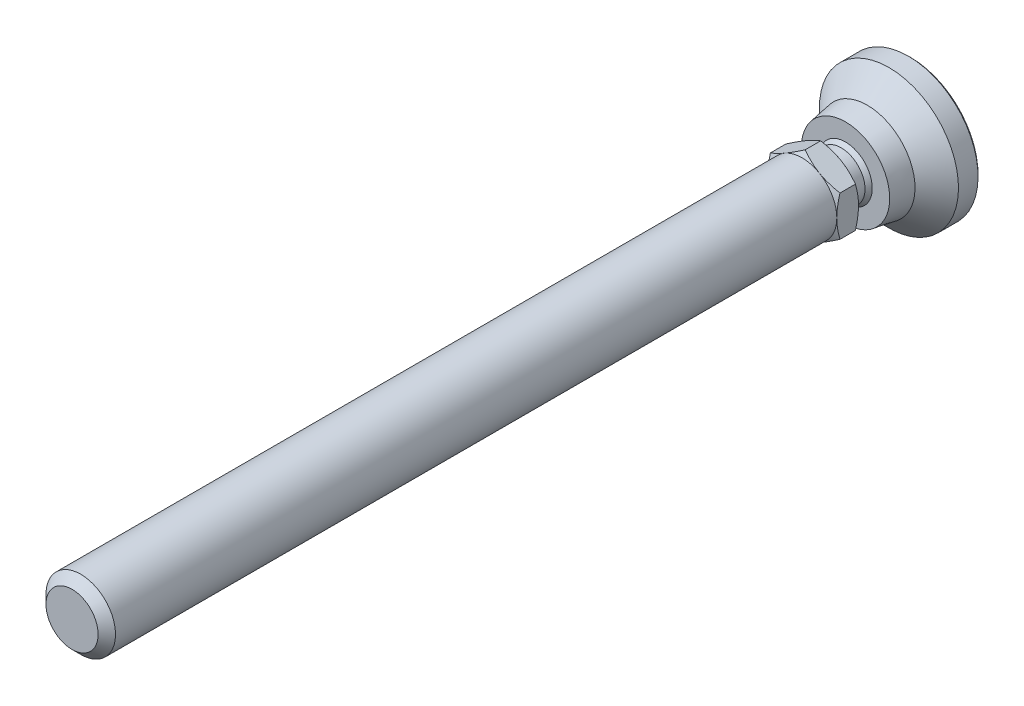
ISO-10303-21;
HEADER;
FILE_DESCRIPTION(('STEP AP214'),'2;1');
FILE_NAME('part.step','',(''),(''),'','','');
FILE_SCHEMA(('AUTOMOTIVE_DESIGN { 1 0 10303 214 1 1 1 1 }'));
ENDSEC;
DATA;
#1=APPLICATION_CONTEXT('core data for automotive mechanical design processes');
#2=APPLICATION_PROTOCOL_DEFINITION('international standard','automotive_design',2000,#1);
#3=PRODUCT_CONTEXT('',#1,'mechanical');
#4=PRODUCT('Part','Part','',(#3));
#5=PRODUCT_RELATED_PRODUCT_CATEGORY('part','',(#4));
#6=PRODUCT_DEFINITION_FORMATION('','',#4);
#7=PRODUCT_DEFINITION_CONTEXT('part definition',#1,'design');
#8=PRODUCT_DEFINITION('design','',#6,#7);
#9=PRODUCT_DEFINITION_SHAPE('','',#8);
#10=(LENGTH_UNIT() NAMED_UNIT(*) SI_UNIT(.MILLI.,.METRE.));
#11=(NAMED_UNIT(*) PLANE_ANGLE_UNIT() SI_UNIT($,.RADIAN.));
#12=(NAMED_UNIT(*) SI_UNIT($,.STERADIAN.) SOLID_ANGLE_UNIT());
#13=UNCERTAINTY_MEASURE_WITH_UNIT(LENGTH_MEASURE(1.E-05),#10,'distance_accuracy_value','');
#14=(GEOMETRIC_REPRESENTATION_CONTEXT(3) GLOBAL_UNCERTAINTY_ASSIGNED_CONTEXT((#13)) GLOBAL_UNIT_ASSIGNED_CONTEXT((#10,
#11,#12)) REPRESENTATION_CONTEXT('',''));
#15=CARTESIAN_POINT('',(0.,0.,0.));
#16=DIRECTION('',(0.,0.,1.));
#17=DIRECTION('',(1.,0.,0.));
#18=AXIS2_PLACEMENT_3D('',#15,#16,#17);
#19=CARTESIAN_POINT('',(-7.7647058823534,0.,20.));
#20=DIRECTION('',(0.,0.,1.));
#21=DIRECTION('',(0.,-1.,0.));
#22=AXIS2_PLACEMENT_3D('',#19,#20,#21);
#23=PLANE('',#22);
#24=CARTESIAN_POINT('',(0.,0.,20.));
#25=DIRECTION('',(0.,0.,-1.));
#26=DIRECTION('',(0.,1.,0.));
#27=AXIS2_PLACEMENT_3D('',#24,#25,#26);
#28=CIRCLE('',#27,5.50000000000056);
#29=CARTESIAN_POINT('',(0.,5.50000000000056,20.));
#30=VERTEX_POINT('',#29);
#31=EDGE_CURVE('E275',#30,#30,#28,.T.);
#32=ORIENTED_EDGE('',*,*,#31,.F.);
#33=EDGE_LOOP('',(#32));
#34=FACE_BOUND('',#33,.T.);
#35=CARTESIAN_POINT('',(0.,0.,20.));
#36=DIRECTION('',(0.,0.,1.));
#37=DIRECTION('',(0.,-1.,0.));
#38=AXIS2_PLACEMENT_3D('',#35,#36,#37);
#39=CIRCLE('',#38,8.);
#40=CARTESIAN_POINT('',(4.,-6.92820323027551,20.));
#41=VERTEX_POINT('',#40);
#42=CARTESIAN_POINT('',(-4.,-6.92820323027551,20.));
#43=VERTEX_POINT('',#42);
#44=EDGE_CURVE('E17',#41,#43,#39,.F.);
#45=ORIENTED_EDGE('',*,*,#44,.T.);
#46=CARTESIAN_POINT('',(-8.,0.,20.));
#47=VERTEX_POINT('',#46);
#48=EDGE_CURVE('E9',#43,#47,#39,.F.);
#49=ORIENTED_EDGE('',*,*,#48,.T.);
#50=CARTESIAN_POINT('',(-4.,6.92820323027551,20.));
#51=VERTEX_POINT('',#50);
#52=EDGE_CURVE('E22',#47,#51,#39,.F.);
#53=ORIENTED_EDGE('',*,*,#52,.T.);
#54=CARTESIAN_POINT('',(4.,6.92820323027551,20.));
#55=VERTEX_POINT('',#54);
#56=EDGE_CURVE('E410',#51,#55,#39,.F.);
#57=ORIENTED_EDGE('',*,*,#56,.T.);
#58=CARTESIAN_POINT('',(8.,0.,20.));
#59=VERTEX_POINT('',#58);
#60=EDGE_CURVE('E120',#55,#59,#39,.F.);
#61=ORIENTED_EDGE('',*,*,#60,.T.);
#62=CARTESIAN_POINT('',(0.,0.,20.));
#63=DIRECTION('',(0.,0.,1.));
#64=DIRECTION('',(0.,-1.,0.));
#65=AXIS2_PLACEMENT_3D('',#62,#63,#64);
#66=CIRCLE('',#65,8.);
#67=EDGE_CURVE('E104',#41,#59,#66,.T.);
#68=ORIENTED_EDGE('',*,*,#67,.F.);
#69=EDGE_LOOP('',(#45,#49,#53,#57,#61,#68));
#70=FACE_BOUND('',#69,.T.);
#71=ADVANCED_FACE('F14',(#34,#70),#23,.F.);
#72=CARTESIAN_POINT('',(0.,0.,0.));
#73=DIRECTION('',(0.,0.,-1.));
#74=DIRECTION('',(0.,1.,0.));
#75=AXIS2_PLACEMENT_3D('',#72,#73,#74);
#76=CYLINDRICAL_SURFACE('',#75,5.50000000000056);
#77=CARTESIAN_POINT('',(0.,0.,15.9999999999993));
#78=DIRECTION('',(0.,0.,-1.));
#79=DIRECTION('',(0.,1.,0.));
#80=AXIS2_PLACEMENT_3D('',#77,#78,#79);
#81=CIRCLE('',#80,5.50000000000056);
#82=CARTESIAN_POINT('',(0.,-5.50000000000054,15.9999999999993));
#83=VERTEX_POINT('',#82);
#84=EDGE_CURVE('E239',#83,#83,#81,.T.);
#85=ORIENTED_EDGE('',*,*,#84,.F.);
#86=EDGE_LOOP('',(#85));
#87=FACE_BOUND('',#86,.T.);
#88=ORIENTED_EDGE('',*,*,#31,.T.);
#89=EDGE_LOOP('',(#88));
#90=FACE_BOUND('',#89,.T.);
#91=ADVANCED_FACE('F342',(#87,#90),#76,.T.);
#92=CARTESIAN_POINT('',(0.,0.,11.6698729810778));
#93=DIRECTION('',(0.,0.,-1.));
#94=DIRECTION('',(0.,-1.,0.));
#95=AXIS2_PLACEMENT_3D('',#92,#93,#94);
#96=SPHERICAL_SURFACE('',#95,7.);
#97=CARTESIAN_POINT('',(0.,0.,15.));
#98=DIRECTION('',(0.,0.,-1.));
#99=DIRECTION('',(0.,1.,0.));
#100=AXIS2_PLACEMENT_3D('',#97,#98,#99);
#101=CIRCLE('',#100,6.15713034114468);
#102=CARTESIAN_POINT('',(0.,-6.15713034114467,15.));
#103=VERTEX_POINT('',#102);
#104=EDGE_CURVE('E243',#103,#103,#101,.T.);
#105=CARTESIAN_POINT('',(0.,-5.50000000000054,15.9999999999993));
#106=CARTESIAN_POINT('',(0.,-5.50771979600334,15.9901945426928));
#107=CARTESIAN_POINT('',(0.,-5.5154133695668,15.9803684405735));
#108=CARTESIAN_POINT('',(0.,-5.5307478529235,15.9606752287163));
#109=CARTESIAN_POINT('',(0.,-5.53838876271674,15.9508081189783));
#110=CARTESIAN_POINT('',(0.,-5.55361769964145,15.9310331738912));
#111=CARTESIAN_POINT('',(0.,-5.56120572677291,15.9211253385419));
#112=CARTESIAN_POINT('',(0.,-5.57632868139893,15.9012692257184));
#113=CARTESIAN_POINT('',(0.,-5.58386360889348,15.8913209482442));
#114=CARTESIAN_POINT('',(0.,-5.59888014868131,15.8713842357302));
#115=CARTESIAN_POINT('',(0.,-5.60636176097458,15.8613958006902));
#116=CARTESIAN_POINT('',(0.,-5.62127145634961,15.8413790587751));
#117=CARTESIAN_POINT('',(0.,-5.62869953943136,15.8313507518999));
#118=CARTESIAN_POINT('',(0.,-5.64350196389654,15.8112545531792));
#119=CARTESIAN_POINT('',(0.,-5.65087630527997,15.8011866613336));
#120=CARTESIAN_POINT('',(0.,-5.66557103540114,15.7810115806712));
#121=CARTESIAN_POINT('',(0.,-5.67289142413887,15.7709043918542));
#122=CARTESIAN_POINT('',(0.,-5.68747803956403,15.7506510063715));
#123=CARTESIAN_POINT('',(0.,-5.69474426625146,15.7405048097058));
#124=CARTESIAN_POINT('',(0.,-5.70922234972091,15.7201736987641));
#125=CARTESIAN_POINT('',(0.,-5.71643420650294,15.7099887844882));
#126=CARTESIAN_POINT('',(0.,-5.73080334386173,15.6895805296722));
#127=CARTESIAN_POINT('',(0.,-5.73796062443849,15.6793571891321));
#128=CARTESIAN_POINT('',(0.,-5.75222040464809,15.6588723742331));
#129=CARTESIAN_POINT('',(0.,-5.75932290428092,15.6486108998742));
#130=CARTESIAN_POINT('',(0.,-5.77347291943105,15.6280501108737));
#131=CARTESIAN_POINT('',(0.,-5.78052043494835,15.6177507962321));
#132=CARTESIAN_POINT('',(0.,-5.79456028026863,15.5971146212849));
#133=CARTESIAN_POINT('',(0.,-5.80155261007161,15.5867777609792));
#134=CARTESIAN_POINT('',(0.,-5.81548188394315,15.5660667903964));
#135=CARTESIAN_POINT('',(0.,-5.82241882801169,15.5556926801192));
#136=CARTESIAN_POINT('',(0.,-5.83623713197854,15.5349075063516));
#137=CARTESIAN_POINT('',(0.,-5.84311849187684,15.5244964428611));
#138=CARTESIAN_POINT('',(0.,-5.85682543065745,15.503637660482));
#139=CARTESIAN_POINT('',(0.,-5.86365100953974,15.4931899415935));
#140=CARTESIAN_POINT('',(0.,-5.8772461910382,15.4722581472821));
#141=CARTESIAN_POINT('',(0.,-5.88401579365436,15.4617740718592));
#142=CARTESIAN_POINT('',(0.,-5.89749882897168,15.440769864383));
#143=CARTESIAN_POINT('',(0.,-5.90421226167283,15.4302497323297));
#144=CARTESIAN_POINT('',(0.,-5.91758276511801,15.4091737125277));
#145=CARTESIAN_POINT('',(0.,-5.92423983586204,15.398617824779));
#146=CARTESIAN_POINT('',(0.,-5.93749742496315,15.3774705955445));
#147=CARTESIAN_POINT('',(0.,-5.94409794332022,15.3668792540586));
#148=CARTESIAN_POINT('',(0.,-5.9572422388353,15.3456614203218));
#149=CARTESIAN_POINT('',(0.,-5.96378601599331,15.3350349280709));
#150=CARTESIAN_POINT('',(0.,-5.97681664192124,15.3137470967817));
#151=CARTESIAN_POINT('',(0.,-5.98330349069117,15.3030857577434));
#152=CARTESIAN_POINT('',(0.,-5.99622007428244,15.2817285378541));
#153=CARTESIAN_POINT('',(0.,-6.00264980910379,15.271032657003));
#154=CARTESIAN_POINT('',(0.,-6.0154519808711,15.2496066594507));
#155=CARTESIAN_POINT('',(0.,-6.02182441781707,15.2388765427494));
#156=CARTESIAN_POINT('',(0.,-6.03451181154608,15.2173823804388));
#157=CARTESIAN_POINT('',(0.,-6.04082676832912,15.2066183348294));
#158=CARTESIAN_POINT('',(0.,-6.05339902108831,15.1850566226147));
#159=CARTESIAN_POINT('',(0.,-6.05965631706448,15.1742589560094));
#160=CARTESIAN_POINT('',(0.,-6.07211306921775,15.1526303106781));
#161=CARTESIAN_POINT('',(0.,-6.07831252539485,15.1417993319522));
#162=CARTESIAN_POINT('',(0.,-6.09065342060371,15.1201043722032));
#163=CARTESIAN_POINT('',(0.,-6.09679485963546,15.1092403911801));
#164=CARTESIAN_POINT('',(0.,-6.10901954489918,15.0874797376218));
#165=CARTESIAN_POINT('',(0.,-6.11510279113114,15.0765830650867));
#166=CARTESIAN_POINT('',(0.,-6.12721091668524,15.0547573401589));
#167=CARTESIAN_POINT('',(0.,-6.13323579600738,15.0438282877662));
#168=CARTESIAN_POINT('',(0.,-6.14522701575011,15.0219381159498));
#169=CARTESIAN_POINT('',(0.,-6.15119335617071,15.010976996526));
#170=CARTESIAN_POINT('',(0.,-6.15713034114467,15.));
#171=B_SPLINE_CURVE_WITH_KNOTS('',3,(#105,#106,#107,#108,#109,#110,#111,#112,#113,#114,#115,
#116,#117,#118,#119,#120,#121,#122,#123,#124,#125,#126,#127,#128,#129,#130,#131,#132,#133,#134,
#135,#136,#137,#138,#139,#140,#141,#142,#143,#144,#145,#146,#147,#148,#149,#150,#151,#152,#153,
#154,#155,#156,#157,#158,#159,#160,#161,#162,#163,#164,#165,#166,#167,#168,#169,#170),
.UNSPECIFIED.,.F.,.F.,(4,2,2,2,2,2,2,2,2,2,2,2,2,2,2,2,2,2,2,2,2,2,2,2,2,2,2,2,2,2,2,2,4),(0.,
0.0374389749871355,0.0748779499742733,0.11231692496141,0.149755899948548,0.187194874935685,
0.224633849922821,0.262072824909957,0.299511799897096,0.336950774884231,0.374389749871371,
0.411828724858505,0.449267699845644,0.486706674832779,0.524145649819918,0.561584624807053,
0.59902359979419,0.636462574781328,0.673901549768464,0.711340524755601,0.748779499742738,
0.786218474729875,0.823657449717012,0.86109642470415,0.898535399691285,0.935974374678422,
0.973413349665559,1.0108523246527,1.04829129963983,1.08573027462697,1.12316924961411,
1.16060822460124,1.19804719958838),.UNSPECIFIED.);
#172=EDGE_CURVE('BSEAM338',#83,#103,#171,.T.);
#173=ORIENTED_EDGE('',*,*,#84,.T.);
#174=ORIENTED_EDGE('',*,*,#104,.F.);
#175=ORIENTED_EDGE('',*,*,#172,.T.);
#176=ORIENTED_EDGE('',*,*,#172,.F.);
#177=EDGE_LOOP('',(#173,#175,#174,#176));
#178=FACE_BOUND('',#177,.T.);
#179=ADVANCED_FACE('F338',(#178),#96,.T.);
#180=CARTESIAN_POINT('',(-15.5,0.,0.));
#181=DIRECTION('',(0.,0.,1.));
#182=DIRECTION('',(0.,-1.,0.));
#183=AXIS2_PLACEMENT_3D('',#180,#181,#182);
#184=PLANE('',#183);
#185=CARTESIAN_POINT('',(0.,0.,0.));
#186=DIRECTION('',(0.,0.,-1.));
#187=DIRECTION('',(0.,1.,0.));
#188=AXIS2_PLACEMENT_3D('',#185,#186,#187);
#189=CIRCLE('',#188,15.5);
#190=CARTESIAN_POINT('',(0.,15.5,0.));
#191=VERTEX_POINT('',#190);
#192=EDGE_CURVE('E264',#191,#191,#189,.T.);
#193=ORIENTED_EDGE('',*,*,#192,.T.);
#194=EDGE_LOOP('',(#193));
#195=FACE_BOUND('',#194,.T.);
#196=ADVANCED_FACE('F341',(#195),#184,.F.);
#197=CARTESIAN_POINT('',(0.,0.,0.500000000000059));
#198=DIRECTION('',(0.,0.,1.));
#199=DIRECTION('',(0.,-1.,0.));
#200=AXIS2_PLACEMENT_3D('',#197,#198,#199);
#201=CONICAL_SURFACE('',#200,16.,0.785398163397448);
#202=ORIENTED_EDGE('',*,*,#192,.F.);
#203=EDGE_LOOP('',(#202));
#204=FACE_BOUND('',#203,.T.);
#205=CARTESIAN_POINT('',(0.,0.,0.500000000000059));
#206=DIRECTION('',(0.,0.,-1.));
#207=DIRECTION('',(0.,1.,0.));
#208=AXIS2_PLACEMENT_3D('',#205,#206,#207);
#209=CIRCLE('',#208,16.);
#210=CARTESIAN_POINT('',(0.,16.,0.500000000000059));
#211=VERTEX_POINT('',#210);
#212=EDGE_CURVE('E267',#211,#211,#209,.T.);
#213=ORIENTED_EDGE('',*,*,#212,.T.);
#214=EDGE_LOOP('',(#213));
#215=FACE_BOUND('',#214,.T.);
#216=ADVANCED_FACE('F378',(#204,#215),#201,.T.);
#217=CARTESIAN_POINT('',(0.,0.,0.));
#218=DIRECTION('',(0.,0.,-1.));
#219=DIRECTION('',(0.,1.,0.));
#220=AXIS2_PLACEMENT_3D('',#217,#218,#219);
#221=CYLINDRICAL_SURFACE('',#220,16.);
#222=ORIENTED_EDGE('',*,*,#212,.F.);
#223=EDGE_LOOP('',(#222));
#224=FACE_BOUND('',#223,.T.);
#225=CARTESIAN_POINT('',(0.,0.,5.));
#226=DIRECTION('',(0.,0.,-1.));
#227=DIRECTION('',(0.,1.,0.));
#228=AXIS2_PLACEMENT_3D('',#225,#226,#227);
#229=CIRCLE('',#228,16.);
#230=CARTESIAN_POINT('',(0.,16.,5.));
#231=VERTEX_POINT('',#230);
#232=EDGE_CURVE('E270',#231,#231,#229,.T.);
#233=ORIENTED_EDGE('',*,*,#232,.T.);
#234=EDGE_LOOP('',(#233));
#235=FACE_BOUND('',#234,.T.);
#236=ADVANCED_FACE('F374',(#224,#235),#221,.T.);
#237=CARTESIAN_POINT('',(0.,0.,10.));
#238=DIRECTION('',(0.,0.,-1.));
#239=DIRECTION('',(0.,1.,0.));
#240=AXIS2_PLACEMENT_3D('',#237,#238,#239);
#241=CONICAL_SURFACE('',#240,11.,0.785398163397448);
#242=ORIENTED_EDGE('',*,*,#232,.F.);
#243=EDGE_LOOP('',(#242));
#244=FACE_BOUND('',#243,.T.);
#245=CARTESIAN_POINT('',(0.,0.,10.));
#246=DIRECTION('',(0.,0.,-1.));
#247=DIRECTION('',(0.,1.,0.));
#248=AXIS2_PLACEMENT_3D('',#245,#246,#247);
#249=CIRCLE('',#248,11.);
#250=CARTESIAN_POINT('',(0.,11.,10.));
#251=VERTEX_POINT('',#250);
#252=EDGE_CURVE('E273',#251,#251,#249,.T.);
#253=ORIENTED_EDGE('',*,*,#252,.T.);
#254=EDGE_LOOP('',(#253));
#255=FACE_BOUND('',#254,.T.);
#256=ADVANCED_FACE('F370',(#244,#255),#241,.T.);
#257=CARTESIAN_POINT('',(0.,0.,16.));
#258=DIRECTION('',(0.,0.,-1.));
#259=DIRECTION('',(0.,1.,0.));
#260=AXIS2_PLACEMENT_3D('',#257,#258,#259);
#261=CONICAL_SURFACE('',#260,10.,0.165148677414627);
#262=CARTESIAN_POINT('',(0.,0.,15.));
#263=DIRECTION('',(0.,0.,1.));
#264=DIRECTION('',(0.,-1.,0.));
#265=AXIS2_PLACEMENT_3D('',#262,#263,#264);
#266=CIRCLE('',#265,10.1666666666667);
#267=CARTESIAN_POINT('',(0.,-10.1666666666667,15.));
#268=VERTEX_POINT('',#267);
#269=EDGE_CURVE('E246',#268,#268,#266,.T.);
#270=ORIENTED_EDGE('',*,*,#269,.F.);
#271=EDGE_LOOP('',(#270));
#272=FACE_BOUND('',#271,.T.);
#273=ORIENTED_EDGE('',*,*,#252,.F.);
#274=EDGE_LOOP('',(#273));
#275=FACE_BOUND('',#274,.T.);
#276=ADVANCED_FACE('F336',(#272,#275),#261,.T.);
#277=CARTESIAN_POINT('',(-6.60079601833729,0.,15.));
#278=DIRECTION('',(0.,0.,-1.));
#279=DIRECTION('',(0.,1.,0.));
#280=AXIS2_PLACEMENT_3D('',#277,#278,#279);
#281=PLANE('',#280);
#282=ORIENTED_EDGE('',*,*,#269,.T.);
#283=EDGE_LOOP('',(#282));
#284=FACE_BOUND('',#283,.T.);
#285=ORIENTED_EDGE('',*,*,#104,.T.);
#286=EDGE_LOOP('',(#285));
#287=FACE_BOUND('',#286,.T.);
#288=ADVANCED_FACE('F332',(#284,#287),#281,.F.);
#289=CARTESIAN_POINT('',(0.,0.,20.));
#290=DIRECTION('',(0.,0.,1.));
#291=DIRECTION('',(0.,-1.,0.));
#292=AXIS2_PLACEMENT_3D('',#289,#290,#291);
#293=CONICAL_SURFACE('',#292,8.,1.0471975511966);
#294=ORIENTED_EDGE('',*,*,#44,.F.);
#295=CARTESIAN_POINT('',(-0.00019999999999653,-9.23771977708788,20.714597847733));
#296=CARTESIAN_POINT('',(0.175648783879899,-9.13619343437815,20.6559907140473));
#297=CARTESIAN_POINT('',(0.352153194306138,-9.03428856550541,20.6000434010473));
#298=CARTESIAN_POINT('',(0.706595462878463,-8.829651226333,20.4942010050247));
#299=CARTESIAN_POINT('',(0.884533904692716,-8.72691841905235,20.4443085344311));
#300=CARTESIAN_POINT('',(1.42119823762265,-8.41707512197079,20.3046927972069));
#301=CARTESIAN_POINT('',(1.78204258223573,-8.20874154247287,20.2252811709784));
#302=CARTESIAN_POINT('',(2.32203917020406,-7.89697436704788,20.1321616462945));
#303=CARTESIAN_POINT('',(2.49957818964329,-7.79447216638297,20.1056345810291));
#304=CARTESIAN_POINT('',(2.85545911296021,-7.5890042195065,20.0611531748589));
#305=CARTESIAN_POINT('',(3.03380094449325,-7.48603851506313,20.0431980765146));
#306=CARTESIAN_POINT('',(3.3907916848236,-7.27992981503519,20.0163156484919));
#307=CARTESIAN_POINT('',(3.56944001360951,-7.17678715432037,20.0073780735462));
#308=CARTESIAN_POINT('',(3.9269017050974,-6.97040655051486,19.9987223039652));
#309=CARTESIAN_POINT('',(4.10571506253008,-6.8671686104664,19.9990038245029));
#310=CARTESIAN_POINT('',(4.44001336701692,-6.67416139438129,20.0081450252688));
#311=CARTESIAN_POINT('',(4.59552190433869,-6.58437849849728,20.0158896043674));
#312=CARTESIAN_POINT('',(4.90617476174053,-6.4050229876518,20.0382011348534));
#313=CARTESIAN_POINT('',(5.06131905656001,-6.31545038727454,20.0527685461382));
#314=CARTESIAN_POINT('',(5.52615131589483,-6.04707935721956,20.1063606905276));
#315=CARTESIAN_POINT('',(5.83501648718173,-5.86875596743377,20.1552686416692));
#316=CARTESIAN_POINT('',(6.45602322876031,-5.5102175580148,20.2775394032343));
#317=CARTESIAN_POINT('',(6.76808554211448,-5.33004829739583,20.351420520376));
#318=CARTESIAN_POINT('',(7.38755648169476,-4.97239658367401,20.519100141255));
#319=CARTESIAN_POINT('',(7.69497304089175,-4.79490955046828,20.6128592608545));
#320=CARTESIAN_POINT('',(8.0002,-4.6186866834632,20.714597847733));
#321=B_SPLINE_CURVE_WITH_KNOTS('',3,(#295,#296,#297,#298,#299,#300,#301,#302,#303,#304,#305,
#306,#307,#308,#309,#310,#311,#312,#313,#314,#315,#316,#317,#318,#319,#320),.UNSPECIFIED.,.F.,
.F.,(4,2,2,2,2,2,2,2,2,2,2,2,4),(0.,0.633973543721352,1.26821965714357,2.53934712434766,
3.1593434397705,3.77928496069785,4.39852133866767,5.01773858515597,5.5568023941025,
6.09590254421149,7.17487077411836,8.27776850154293,9.37850115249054),.UNSPECIFIED.);
#322=CARTESIAN_POINT('',(0.,-9.23760430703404,20.7145311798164));
#323=VERTEX_POINT('',#322);
#324=EDGE_CURVE('E112',#323,#41,#321,.T.);
#325=ORIENTED_EDGE('',*,*,#324,.F.);
#326=CARTESIAN_POINT('',(-8.0002,-4.6186866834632,20.714597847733));
#327=CARTESIAN_POINT('',(-7.82435121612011,-4.72021302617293,20.6559907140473));
#328=CARTESIAN_POINT('',(-7.64784680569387,-4.82211789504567,20.6000434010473));
#329=CARTESIAN_POINT('',(-7.29340453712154,-5.02675523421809,20.4942010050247));
#330=CARTESIAN_POINT('',(-7.11546609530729,-5.12948804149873,20.4443085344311));
#331=CARTESIAN_POINT('',(-6.57880176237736,-5.4393313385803,20.3046927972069));
#332=CARTESIAN_POINT('',(-6.21795741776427,-5.64766491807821,20.2252811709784));
#333=CARTESIAN_POINT('',(-5.67796082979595,-5.9594320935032,20.1321616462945));
#334=CARTESIAN_POINT('',(-5.50042181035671,-6.06193429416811,20.1056345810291));
#335=CARTESIAN_POINT('',(-5.1445408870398,-6.26740224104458,20.0611531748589));
#336=CARTESIAN_POINT('',(-4.96619905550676,-6.37036794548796,20.0431980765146));
#337=CARTESIAN_POINT('',(-4.6092083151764,-6.57647664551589,20.0163156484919));
#338=CARTESIAN_POINT('',(-4.43055998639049,-6.67961930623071,20.0073780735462));
#339=CARTESIAN_POINT('',(-4.07309829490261,-6.88599991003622,19.9987223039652));
#340=CARTESIAN_POINT('',(-3.89428493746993,-6.98923785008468,19.9990038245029));
#341=CARTESIAN_POINT('',(-3.55998663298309,-7.18224506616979,20.0081450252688));
#342=CARTESIAN_POINT('',(-3.40447809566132,-7.2720279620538,20.0158896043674));
#343=CARTESIAN_POINT('',(-3.09382523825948,-7.45138347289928,20.0382011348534));
#344=CARTESIAN_POINT('',(-2.93868094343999,-7.54095607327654,20.0527685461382));
#345=CARTESIAN_POINT('',(-2.47384868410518,-7.80932710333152,20.1063606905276));
#346=CARTESIAN_POINT('',(-2.16498351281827,-7.98765049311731,20.1552686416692));
#347=CARTESIAN_POINT('',(-1.5439767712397,-8.34618890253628,20.2775394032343));
#348=CARTESIAN_POINT('',(-1.23191445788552,-8.52635816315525,20.351420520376));
#349=CARTESIAN_POINT('',(-0.612443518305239,-8.88400987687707,20.519100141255));
#350=CARTESIAN_POINT('',(-0.305026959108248,-9.06149691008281,20.6128592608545));
#351=CARTESIAN_POINT('',(0.000200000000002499,-9.23771977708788,20.714597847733));
#352=B_SPLINE_CURVE_WITH_KNOTS('',3,(#326,#327,#328,#329,#330,#331,#332,#333,#334,#335,#336,
#337,#338,#339,#340,#341,#342,#343,#344,#345,#346,#347,#348,#349,#350,#351),.UNSPECIFIED.,.F.,
.F.,(4,2,2,2,2,2,2,2,2,2,2,2,4),(0.,0.633973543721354,1.26821965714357,2.53934712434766,
3.1593434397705,3.77928496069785,4.39852133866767,5.01773858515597,5.5568023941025,
6.09590254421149,7.17487077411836,8.27776850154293,9.37850115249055),.UNSPECIFIED.);
#353=EDGE_CURVE('E118',#43,#323,#352,.T.);
#354=ORIENTED_EDGE('',*,*,#353,.F.);
#355=EDGE_LOOP('',(#294,#325,#354));
#356=FACE_BOUND('',#355,.T.);
#357=ADVANCED_FACE('F116',(#356),#293,.T.);
#358=ORIENTED_EDGE('',*,*,#67,.T.);
#359=CARTESIAN_POINT('',(8.,12.3913794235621,23.8967969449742));
#360=CARTESIAN_POINT('',(8.,12.0421015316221,23.7274273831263));
#361=CARTESIAN_POINT('',(7.99999999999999,11.692020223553,23.5596862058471));
#362=CARTESIAN_POINT('',(7.99999999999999,10.989823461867,23.2283767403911));
#363=CARTESIAN_POINT('',(7.99999999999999,10.6377076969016,23.0648091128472));
#364=CARTESIAN_POINT('',(7.99999999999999,9.92919309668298,22.7419366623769));
#365=CARTESIAN_POINT('',(7.99999999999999,9.57278137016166,22.5826600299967));
#366=CARTESIAN_POINT('',(7.99999999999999,8.85711792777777,22.2706451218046));
#367=CARTESIAN_POINT('',(7.99999999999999,8.49786634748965,22.1179065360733));
#368=CARTESIAN_POINT('',(7.99999999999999,7.76440035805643,21.815938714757));
#369=CARTESIAN_POINT('',(7.99999999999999,7.3900748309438,21.6669778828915));
#370=CARTESIAN_POINT('',(7.99999999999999,6.63703963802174,21.3803671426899));
#371=CARTESIAN_POINT('',(8.,6.25832948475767,21.2427185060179));
#372=CARTESIAN_POINT('',(8.,5.49663180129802,20.9823574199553));
#373=CARTESIAN_POINT('',(7.99999999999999,5.11365476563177,20.8596145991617));
#374=CARTESIAN_POINT('',(8.,4.34222085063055,20.6330122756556));
#375=CARTESIAN_POINT('',(8.,3.95376574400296,20.5291468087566));
#376=CARTESIAN_POINT('',(8.,3.17325146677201,20.3458543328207));
#377=CARTESIAN_POINT('',(8.,2.78122425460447,20.2662949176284));
#378=CARTESIAN_POINT('',(8.,2.18962566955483,20.1686355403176));
#379=CARTESIAN_POINT('',(8.,1.99181849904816,20.1396943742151));
#380=CARTESIAN_POINT('',(8.,1.59522615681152,20.089606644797));
#381=CARTESIAN_POINT('',(8.,1.39644108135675,20.0684593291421));
#382=CARTESIAN_POINT('',(8.,1.00074904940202,20.0346450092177));
#383=CARTESIAN_POINT('',(8.,0.803851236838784,20.0218714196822));
#384=CARTESIAN_POINT('',(8.,0.409691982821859,20.0046609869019));
#385=CARTESIAN_POINT('',(8.,0.212430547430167,20.0002240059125));
#386=CARTESIAN_POINT('',(8.,-0.182103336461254,19.9997925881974));
#387=CARTESIAN_POINT('',(8.,-0.379375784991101,20.0037981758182));
#388=CARTESIAN_POINT('',(8.,-0.773576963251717,20.0201542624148));
#389=CARTESIAN_POINT('',(8.,-0.970505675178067,20.0325051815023));
#390=CARTESIAN_POINT('',(8.,-1.44426123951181,20.0719957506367));
#391=CARTESIAN_POINT('',(8.,-1.72076278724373,20.1031214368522));
#392=CARTESIAN_POINT('',(8.,-2.27169052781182,20.1801230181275));
#393=CARTESIAN_POINT('',(8.,-2.54611643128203,20.2260009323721));
#394=CARTESIAN_POINT('',(8.,-3.36598086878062,20.3833283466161));
#395=CARTESIAN_POINT('',(8.,-3.90769456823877,20.5144421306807));
#396=CARTESIAN_POINT('',(8.,-4.71765443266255,20.7415109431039));
#397=CARTESIAN_POINT('',(8.,-4.99010965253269,20.8233132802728));
#398=CARTESIAN_POINT('',(8.,-5.53237345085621,20.9953423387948));
#399=CARTESIAN_POINT('',(8.,-5.80218201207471,21.0855691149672));
#400=CARTESIAN_POINT('',(8.,-6.33923847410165,21.2730054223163));
#401=CARTESIAN_POINT('',(8.,-6.60648720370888,21.3702126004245));
#402=CARTESIAN_POINT('',(8.,-7.13877558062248,21.5704731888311));
#403=CARTESIAN_POINT('',(8.,-7.40381525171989,21.673526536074));
#404=CARTESIAN_POINT('',(8.,-8.02058326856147,21.919924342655));
#405=CARTESIAN_POINT('',(8.,-8.37154600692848,22.0651814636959));
#406=CARTESIAN_POINT('',(8.,-9.0705506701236,22.3625808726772));
#407=CARTESIAN_POINT('',(8.,-9.4185924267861,22.5147235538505));
#408=CARTESIAN_POINT('',(8.,-10.1122869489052,22.8245402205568));
#409=CARTESIAN_POINT('',(8.,-10.4579391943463,22.9822153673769));
#410=CARTESIAN_POINT('',(8.,-11.1471721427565,23.3020019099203));
#411=CARTESIAN_POINT('',(8.,-11.4907528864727,23.4641132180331));
#412=CARTESIAN_POINT('',(8.,-12.1765392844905,23.7921269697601));
#413=CARTESIAN_POINT('',(8.,-12.5187431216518,23.9580332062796));
#414=CARTESIAN_POINT('',(8.,-13.2016847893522,24.2928388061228));
#415=CARTESIAN_POINT('',(8.,-13.5424226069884,24.4617381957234));
#416=CARTESIAN_POINT('',(8.,-14.5626952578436,24.9720998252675));
#417=CARTESIAN_POINT('',(8.,-15.2403763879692,25.3172675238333));
#418=CARTESIAN_POINT('',(8.,-16.5368149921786,25.9860563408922));
#419=CARTESIAN_POINT('',(8.00000000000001,-17.1558564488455,26.3091293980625));
#420=CARTESIAN_POINT('',(8.00000000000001,-18.3916179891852,26.9597315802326));
#421=CARTESIAN_POINT('',(8.00000000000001,-19.0083379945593,27.2872608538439));
#422=CARTESIAN_POINT('',(8.00000000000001,-20.2384751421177,27.9449280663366));
#423=CARTESIAN_POINT('',(8.00000000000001,-20.8518966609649,28.2750578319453));
#424=CARTESIAN_POINT('',(8.00000000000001,-22.077249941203,28.9379939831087));
#425=CARTESIAN_POINT('',(8.00000000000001,-22.6891817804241,29.2708002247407));
#426=CARTESIAN_POINT('',(8.,-23.3005628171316,29.6046084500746));
#427=B_SPLINE_CURVE_WITH_KNOTS('',3,(#359,#360,#361,#362,#363,#364,#365,#366,#367,#368,#369,
#370,#371,#372,#373,#374,#375,#376,#377,#378,#379,#380,#381,#382,#383,#384,#385,#386,#387,#388,
#389,#390,#391,#392,#393,#394,#395,#396,#397,#398,#399,#400,#401,#402,#403,#404,#405,#406,#407,
#408,#409,#410,#411,#412,#413,#414,#415,#416,#417,#418,#419,#420,#421,#422,#423,#424,#425,#426),
.UNSPECIFIED.,.F.,.F.,(4,2,2,2,2,2,2,2,2,2,2,2,2,2,2,2,2,2,2,2,2,2,2,2,2,2,2,2,2,2,2,2,2,4),(0.,
1.16454417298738,2.32927155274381,3.50036593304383,4.671404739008,5.8798903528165,
7.08851163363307,8.29462742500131,9.5003614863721,10.6994051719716,11.2990152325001,
11.8985673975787,12.4903318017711,13.0820864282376,13.6738427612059,14.2656288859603,
15.0999008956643,15.9342871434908,17.6039942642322,18.4573354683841,19.3106822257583,
20.1637426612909,21.0167938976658,22.1562002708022,23.295671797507,24.4353839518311,
25.5750736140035,26.7159569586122,27.8568503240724,30.1383469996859,32.2331537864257,
34.328030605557,36.4178667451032,38.5075912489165),.UNSPECIFIED.);
#428=CARTESIAN_POINT('',(8.,-4.61880215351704,20.7145311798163));
#429=VERTEX_POINT('',#428);
#430=EDGE_CURVE('E107',#429,#59,#427,.F.);
#431=ORIENTED_EDGE('',*,*,#430,.F.);
#432=EDGE_CURVE('E100',#41,#429,#321,.T.);
#433=ORIENTED_EDGE('',*,*,#432,.F.);
#434=EDGE_LOOP('',(#358,#431,#433));
#435=FACE_BOUND('',#434,.T.);
#436=ADVANCED_FACE('F102',(#435),#293,.T.);
#437=ORIENTED_EDGE('',*,*,#60,.F.);
#438=CARTESIAN_POINT('',(8.0002,4.61868668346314,20.7145978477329));
#439=CARTESIAN_POINT('',(7.8243512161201,4.72021302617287,20.6559907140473));
#440=CARTESIAN_POINT('',(7.64784680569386,4.82211789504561,20.6000434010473));
#441=CARTESIAN_POINT('',(7.29340453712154,5.02675523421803,20.4942010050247));
#442=CARTESIAN_POINT('',(7.11546609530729,5.12948804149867,20.4443085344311));
#443=CARTESIAN_POINT('',(6.57880176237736,5.43933133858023,20.3046927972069));
#444=CARTESIAN_POINT('',(6.21795741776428,5.64766491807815,20.2252811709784));
#445=CARTESIAN_POINT('',(5.67796082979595,5.95943209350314,20.1321616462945));
#446=CARTESIAN_POINT('',(5.50042181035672,6.06193429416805,20.1056345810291));
#447=CARTESIAN_POINT('',(5.14454088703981,6.26740224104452,20.0611531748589));
#448=CARTESIAN_POINT('',(4.96619905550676,6.37036794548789,20.0431980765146));
#449=CARTESIAN_POINT('',(4.60920831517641,6.57647664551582,20.0163156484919));
#450=CARTESIAN_POINT('',(4.4305599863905,6.67961930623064,20.0073780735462));
#451=CARTESIAN_POINT('',(4.07309829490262,6.88599991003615,19.9987223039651));
#452=CARTESIAN_POINT('',(3.89428493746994,6.98923785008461,19.9990038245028));
#453=CARTESIAN_POINT('',(3.5599866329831,7.18224506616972,20.0081450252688));
#454=CARTESIAN_POINT('',(3.40447809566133,7.27202796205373,20.0158896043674));
#455=CARTESIAN_POINT('',(3.09382523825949,7.45138347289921,20.0382011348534));
#456=CARTESIAN_POINT('',(2.93868094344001,7.54095607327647,20.0527685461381));
#457=CARTESIAN_POINT('',(2.47384868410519,7.80932710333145,20.1063606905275));
#458=CARTESIAN_POINT('',(2.16498351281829,7.98765049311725,20.1552686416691));
#459=CARTESIAN_POINT('',(1.54397677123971,8.34618890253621,20.2775394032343));
#460=CARTESIAN_POINT('',(1.23191445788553,8.52635816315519,20.351420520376));
#461=CARTESIAN_POINT('',(0.612443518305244,8.88400987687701,20.519100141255));
#462=CARTESIAN_POINT('',(0.305026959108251,9.06149691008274,20.6128592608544));
#463=CARTESIAN_POINT('',(-0.000200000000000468,9.23771977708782,20.7145978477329));
#464=B_SPLINE_CURVE_WITH_KNOTS('',3,(#438,#439,#440,#441,#442,#443,#444,#445,#446,#447,#448,
#449,#450,#451,#452,#453,#454,#455,#456,#457,#458,#459,#460,#461,#462,#463),.UNSPECIFIED.,.F.,
.F.,(4,2,2,2,2,2,2,2,2,2,2,2,4),(0.,0.633973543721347,1.26821965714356,2.53934712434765,
3.15934343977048,3.77928496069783,4.39852133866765,5.01773858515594,5.55680239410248,
6.09590254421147,7.17487077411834,8.27776850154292,9.37850115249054),.UNSPECIFIED.);
#465=CARTESIAN_POINT('',(8.,4.61880215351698,20.7145311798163));
#466=VERTEX_POINT('',#465);
#467=EDGE_CURVE('E187',#466,#55,#464,.T.);
#468=ORIENTED_EDGE('',*,*,#467,.F.);
#469=EDGE_CURVE('E139',#59,#466,#427,.F.);
#470=ORIENTED_EDGE('',*,*,#469,.F.);
#471=EDGE_LOOP('',(#437,#468,#470));
#472=FACE_BOUND('',#471,.T.);
#473=ADVANCED_FACE('F409',(#472),#293,.T.);
#474=ORIENTED_EDGE('',*,*,#56,.F.);
#475=CARTESIAN_POINT('',(0.000199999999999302,9.23771977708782,20.7145978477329));
#476=CARTESIAN_POINT('',(-0.175648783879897,9.13619343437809,20.6559907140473));
#477=CARTESIAN_POINT('',(-0.352153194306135,9.03428856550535,20.6000434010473));
#478=CARTESIAN_POINT('',(-0.706595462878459,8.82965122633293,20.4942010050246));
#479=CARTESIAN_POINT('',(-0.884533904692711,8.72691841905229,20.4443085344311));
#480=CARTESIAN_POINT('',(-1.42119823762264,8.41707512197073,20.3046927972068));
#481=CARTESIAN_POINT('',(-1.78204258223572,8.20874154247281,20.2252811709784));
#482=CARTESIAN_POINT('',(-2.32203917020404,7.89697436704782,20.1321616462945));
#483=CARTESIAN_POINT('',(-2.49957818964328,7.79447216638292,20.1056345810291));
#484=CARTESIAN_POINT('',(-2.85545911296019,7.58900421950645,20.0611531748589));
#485=CARTESIAN_POINT('',(-3.03380094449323,7.48603851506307,20.0431980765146));
#486=CARTESIAN_POINT('',(-3.39079168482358,7.27992981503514,20.0163156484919));
#487=CARTESIAN_POINT('',(-3.56944001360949,7.17678715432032,20.0073780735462));
#488=CARTESIAN_POINT('',(-3.92690170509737,6.97040655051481,19.9987223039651));
#489=CARTESIAN_POINT('',(-4.10571506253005,6.86716861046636,19.9990038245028));
#490=CARTESIAN_POINT('',(-4.44001336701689,6.67416139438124,20.0081450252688));
#491=CARTESIAN_POINT('',(-4.59552190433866,6.58437849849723,20.0158896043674));
#492=CARTESIAN_POINT('',(-4.9061747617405,6.40502298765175,20.0382011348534));
#493=CARTESIAN_POINT('',(-5.06131905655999,6.31545038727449,20.0527685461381));
#494=CARTESIAN_POINT('',(-5.52615131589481,6.04707935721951,20.1063606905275));
#495=CARTESIAN_POINT('',(-5.83501648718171,5.86875596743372,20.1552686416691));
#496=CARTESIAN_POINT('',(-6.45602322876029,5.51021755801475,20.2775394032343));
#497=CARTESIAN_POINT('',(-6.76808554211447,5.33004829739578,20.351420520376));
#498=CARTESIAN_POINT('',(-7.38755648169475,4.97239658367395,20.519100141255));
#499=CARTESIAN_POINT('',(-7.69497304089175,4.79490955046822,20.6128592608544));
#500=CARTESIAN_POINT('',(-8.0002,4.61868668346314,20.7145978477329));
#501=B_SPLINE_CURVE_WITH_KNOTS('',3,(#475,#476,#477,#478,#479,#480,#481,#482,#483,#484,#485,
#486,#487,#488,#489,#490,#491,#492,#493,#494,#495,#496,#497,#498,#499,#500),.UNSPECIFIED.,.F.,
.F.,(4,2,2,2,2,2,2,2,2,2,2,2,4),(0.,0.633973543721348,1.26821965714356,2.53934712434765,
3.15934343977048,3.77928496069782,4.39852133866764,5.01773858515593,5.55680239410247,
6.09590254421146,7.17487077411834,8.27776850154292,9.37850115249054),.UNSPECIFIED.);
#502=CARTESIAN_POINT('',(0.,9.23760430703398,20.7145311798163));
#503=VERTEX_POINT('',#502);
#504=EDGE_CURVE('E188',#503,#51,#501,.T.);
#505=ORIENTED_EDGE('',*,*,#504,.F.);
#506=EDGE_CURVE('E180',#55,#503,#464,.T.);
#507=ORIENTED_EDGE('',*,*,#506,.F.);
#508=EDGE_LOOP('',(#474,#505,#507));
#509=FACE_BOUND('',#508,.T.);
#510=ADVANCED_FACE('F416',(#509),#293,.T.);
#511=ORIENTED_EDGE('',*,*,#52,.F.);
#512=CARTESIAN_POINT('',(-8.,12.3913794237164,23.8967969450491));
#513=CARTESIAN_POINT('',(-8.,12.0421015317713,23.727427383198));
#514=CARTESIAN_POINT('',(-8.,11.692020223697,23.5596862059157));
#515=CARTESIAN_POINT('',(-8.,10.9898234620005,23.2283767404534));
#516=CARTESIAN_POINT('',(-8.,10.6377076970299,23.0648091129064));
#517=CARTESIAN_POINT('',(-8.,9.92919309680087,22.7419366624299));
#518=CARTESIAN_POINT('',(-8.,9.57278137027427,22.5826600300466));
#519=CARTESIAN_POINT('',(-8.,8.85711792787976,22.2706451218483));
#520=CARTESIAN_POINT('',(-8.,8.49786634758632,22.1179065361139));
#521=CARTESIAN_POINT('',(-8.,7.76440035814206,21.8159387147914));
#522=CARTESIAN_POINT('',(-8.,7.39007483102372,21.6669778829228));
#523=CARTESIAN_POINT('',(-8.,6.63703963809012,21.3803671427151));
#524=CARTESIAN_POINT('',(-8.,6.25832948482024,21.2427185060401));
#525=CARTESIAN_POINT('',(-8.,5.49663180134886,20.9823574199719));
#526=CARTESIAN_POINT('',(-8.,5.11365476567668,20.8596145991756));
#527=CARTESIAN_POINT('',(-8.,4.34222085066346,20.6330122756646));
#528=CARTESIAN_POINT('',(-8.,3.95376574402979,20.5291468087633));
#529=CARTESIAN_POINT('',(-8.,3.17325146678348,20.3458543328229));
#530=CARTESIAN_POINT('',(-8.,2.78122425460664,20.2662949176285));
#531=CARTESIAN_POINT('',(-8.,2.18962566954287,20.1686355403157));
#532=CARTESIAN_POINT('',(-8.,1.99181849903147,20.1396943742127));
#533=CARTESIAN_POINT('',(-8.,1.59522615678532,20.089606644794));
#534=CARTESIAN_POINT('',(-8.,1.39644108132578,20.0684593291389));
#535=CARTESIAN_POINT('',(-8.,1.00074904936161,20.0346450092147));
#536=CARTESIAN_POINT('',(-8.,0.803851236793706,20.0218714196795));
#537=CARTESIAN_POINT('',(-8.,0.409691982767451,20.0046609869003));
#538=CARTESIAN_POINT('',(-8.,0.212430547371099,20.0002240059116));
#539=CARTESIAN_POINT('',(-8.,-0.182103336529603,19.9997925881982));
#540=CARTESIAN_POINT('',(-8.,-0.379375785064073,20.0037981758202));
#541=CARTESIAN_POINT('',(-8.,-0.773576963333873,20.0201542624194));
#542=CARTESIAN_POINT('',(-8.,-0.970505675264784,20.0325051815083));
#543=CARTESIAN_POINT('',(-8.,-1.44426123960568,20.0719957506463));
#544=CARTESIAN_POINT('',(-8.,-1.72076278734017,20.1031214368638));
#545=CARTESIAN_POINT('',(-8.,-2.27169052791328,20.1801230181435));
#546=CARTESIAN_POINT('',(-8.,-2.54611643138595,20.2260009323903));
#547=CARTESIAN_POINT('',(-8.,-3.36598086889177,20.3833283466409));
#548=CARTESIAN_POINT('',(-8.,-3.90769456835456,20.5144421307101));
#549=CARTESIAN_POINT('',(-8.,-4.71765443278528,20.7415109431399));
#550=CARTESIAN_POINT('',(-8.,-4.99010965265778,20.823313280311));
#551=CARTESIAN_POINT('',(-8.,-5.53237345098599,20.9953423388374));
#552=CARTESIAN_POINT('',(-8.,-5.80218201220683,21.085569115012));
#553=CARTESIAN_POINT('',(-8.,-6.33923847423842,21.2730054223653));
#554=CARTESIAN_POINT('',(-8.,-6.60648720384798,21.3702126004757));
#555=CARTESIAN_POINT('',(-8.,-7.13877558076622,21.5704731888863));
#556=CARTESIAN_POINT('',(-8.,-7.40381525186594,21.6735265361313));
#557=CARTESIAN_POINT('',(-8.,-8.02058326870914,21.9199243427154));
#558=CARTESIAN_POINT('',(-8.,-8.37154600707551,22.0651814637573));
#559=CARTESIAN_POINT('',(-8.,-9.07055067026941,22.3625808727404));
#560=CARTESIAN_POINT('',(-8.,-9.41859242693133,22.5147235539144));
#561=CARTESIAN_POINT('',(-8.,-10.1122869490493,22.8245402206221));
#562=CARTESIAN_POINT('',(-8.,-10.45793919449,22.9822153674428));
#563=CARTESIAN_POINT('',(-8.,-11.1471721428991,23.3020019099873));
#564=CARTESIAN_POINT('',(-8.,-11.4907528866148,23.4641132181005));
#565=CARTESIAN_POINT('',(-8.,-12.1765392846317,23.7921269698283));
#566=CARTESIAN_POINT('',(-8.,-12.5187431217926,23.9580332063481));
#567=CARTESIAN_POINT('',(-8.,-13.2016847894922,24.2928388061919));
#568=CARTESIAN_POINT('',(-8.,-13.542422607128,24.4617381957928));
#569=CARTESIAN_POINT('',(-8.,-14.562695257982,24.9720998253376));
#570=CARTESIAN_POINT('',(-8.,-15.2403763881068,25.3172675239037));
#571=CARTESIAN_POINT('',(-8.,-16.5368149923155,25.9860563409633));
#572=CARTESIAN_POINT('',(-8.,-17.1558564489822,26.3091293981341));
#573=CARTESIAN_POINT('',(-8.,-18.3916179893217,26.9597315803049));
#574=CARTESIAN_POINT('',(-7.99999999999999,-19.0083379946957,27.2872608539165));
#575=CARTESIAN_POINT('',(-7.99999999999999,-20.2384751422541,27.9449280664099));
#576=CARTESIAN_POINT('',(-7.99999999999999,-20.8518966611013,28.2750578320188));
#577=CARTESIAN_POINT('',(-7.99999999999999,-22.0772499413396,28.9379939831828));
#578=CARTESIAN_POINT('',(-8.,-22.6891817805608,29.2708002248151));
#579=CARTESIAN_POINT('',(-8.,-23.3005628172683,29.6046084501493));
#580=B_SPLINE_CURVE_WITH_KNOTS('',3,(#512,#513,#514,#515,#516,#517,#518,#519,#520,#521,#522,
#523,#524,#525,#526,#527,#528,#529,#530,#531,#532,#533,#534,#535,#536,#537,#538,#539,#540,#541,
#542,#543,#544,#545,#546,#547,#548,#549,#550,#551,#552,#553,#554,#555,#556,#557,#558,#559,#560,
#561,#562,#563,#564,#565,#566,#567,#568,#569,#570,#571,#572,#573,#574,#575,#576,#577,#578,#579),
.UNSPECIFIED.,.F.,.F.,(4,2,2,2,2,2,2,2,2,2,2,2,2,2,2,2,2,2,2,2,2,2,2,2,2,2,2,2,2,2,2,2,2,4),(0.,
1.16454417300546,2.32927155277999,3.50036593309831,4.67140473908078,5.87989035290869,
7.08851163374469,8.29462742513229,9.50036148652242,10.6994051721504,11.2990152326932,
11.8985673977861,12.4903318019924,13.0820864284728,13.673842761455,14.2656288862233,
15.0999008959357,15.9342871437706,17.6039942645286,18.4573354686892,19.3106822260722,
20.1637426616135,21.0167938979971,22.1562002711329,23.2956717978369,24.4353839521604,
25.5750736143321,26.71595695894,27.8568503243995,30.1383470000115,32.2331537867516,
34.3280306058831,36.4178667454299,38.5075912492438),.UNSPECIFIED.);
#581=CARTESIAN_POINT('',(-8.,4.61880215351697,20.7145311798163));
#582=VERTEX_POINT('',#581);
#583=EDGE_CURVE('E418',#582,#47,#580,.T.);
#584=ORIENTED_EDGE('',*,*,#583,.F.);
#585=EDGE_CURVE('E173',#51,#582,#501,.T.);
#586=ORIENTED_EDGE('',*,*,#585,.F.);
#587=EDGE_LOOP('',(#511,#584,#586));
#588=FACE_BOUND('',#587,.T.);
#589=ADVANCED_FACE('F158',(#588),#293,.T.);
#590=CARTESIAN_POINT('',(-8.,-4.61880215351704,20.7145311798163));
#591=VERTEX_POINT('',#590);
#592=EDGE_CURVE('E124',#47,#591,#580,.T.);
#593=ORIENTED_EDGE('',*,*,#592,.F.);
#594=ORIENTED_EDGE('',*,*,#48,.F.);
#595=EDGE_CURVE('E31',#591,#43,#352,.T.);
#596=ORIENTED_EDGE('',*,*,#595,.F.);
#597=EDGE_LOOP('',(#593,#594,#596));
#598=FACE_BOUND('',#597,.T.);
#599=ADVANCED_FACE('F153',(#598),#293,.T.);
#600=CARTESIAN_POINT('',(0.,0.,193.));
#601=DIRECTION('',(0.,0.,-1.));
#602=DIRECTION('',(0.,1.,0.));
#603=AXIS2_PLACEMENT_3D('',#600,#601,#602);
#604=PLANE('',#603);
#605=CARTESIAN_POINT('',(0.,0.,193.));
#606=DIRECTION('',(0.,0.,-1.));
#607=DIRECTION('',(0.,1.,0.));
#608=AXIS2_PLACEMENT_3D('',#605,#606,#607);
#609=CIRCLE('',#608,6.);
#610=CARTESIAN_POINT('',(0.,6.,193.));
#611=VERTEX_POINT('',#610);
#612=EDGE_CURVE('E230',#611,#611,#609,.T.);
#613=ORIENTED_EDGE('',*,*,#612,.F.);
#614=EDGE_LOOP('',(#613));
#615=FACE_BOUND('',#614,.T.);
#616=ADVANCED_FACE('F157',(#615),#604,.F.);
#617=CARTESIAN_POINT('',(0.,0.,193.));
#618=DIRECTION('',(0.,0.,-1.));
#619=DIRECTION('',(0.,1.,0.));
#620=AXIS2_PLACEMENT_3D('',#617,#618,#619);
#621=CONICAL_SURFACE('',#620,6.,0.785398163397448);
#622=CARTESIAN_POINT('',(0.,0.,191.));
#623=DIRECTION('',(0.,0.,-1.));
#624=DIRECTION('',(0.,1.,0.));
#625=AXIS2_PLACEMENT_3D('',#622,#623,#624);
#626=CIRCLE('',#625,8.);
#627=CARTESIAN_POINT('',(0.,8.,191.));
#628=VERTEX_POINT('',#627);
#629=EDGE_CURVE('E233',#628,#628,#626,.T.);
#630=ORIENTED_EDGE('',*,*,#629,.F.);
#631=EDGE_LOOP('',(#630));
#632=FACE_BOUND('',#631,.T.);
#633=ORIENTED_EDGE('',*,*,#612,.T.);
#634=EDGE_LOOP('',(#633));
#635=FACE_BOUND('',#634,.T.);
#636=ADVANCED_FACE('F346',(#632,#635),#621,.T.);
#637=CARTESIAN_POINT('',(0.,0.,-2.68477183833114));
#638=DIRECTION('',(0.,0.,-1.));
#639=DIRECTION('',(0.,1.,0.));
#640=AXIS2_PLACEMENT_3D('',#637,#638,#639);
#641=CYLINDRICAL_SURFACE('',#640,8.);
#642=CARTESIAN_POINT('',(0.,0.,25.));
#643=DIRECTION('',(0.,0.,-1.));
#644=DIRECTION('',(0.,1.,0.));
#645=AXIS2_PLACEMENT_3D('',#642,#643,#644);
#646=CIRCLE('',#645,8.);
#647=CARTESIAN_POINT('',(4.,6.92820323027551,25.));
#648=VERTEX_POINT('',#647);
#649=CARTESIAN_POINT('',(8.,0.,25.));
#650=VERTEX_POINT('',#649);
#651=EDGE_CURVE('E236',#648,#650,#646,.T.);
#652=ORIENTED_EDGE('',*,*,#651,.F.);
#653=CARTESIAN_POINT('',(-4.,6.92820323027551,25.));
#654=VERTEX_POINT('',#653);
#655=EDGE_CURVE('E240',#654,#648,#646,.T.);
#656=ORIENTED_EDGE('',*,*,#655,.F.);
#657=CARTESIAN_POINT('',(-8.,0.,25.));
#658=VERTEX_POINT('',#657);
#659=EDGE_CURVE('E280',#658,#654,#646,.T.);
#660=ORIENTED_EDGE('',*,*,#659,.F.);
#661=CARTESIAN_POINT('',(-4.,-6.92820323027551,25.));
#662=VERTEX_POINT('',#661);
#663=EDGE_CURVE('E285',#662,#658,#646,.T.);
#664=ORIENTED_EDGE('',*,*,#663,.F.);
#665=CARTESIAN_POINT('',(4.,-6.92820323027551,25.));
#666=VERTEX_POINT('',#665);
#667=EDGE_CURVE('E121',#666,#662,#646,.T.);
#668=ORIENTED_EDGE('',*,*,#667,.F.);
#669=CARTESIAN_POINT('',(0.,0.,25.));
#670=DIRECTION('',(0.,0.,1.));
#671=DIRECTION('',(0.,-1.,0.));
#672=AXIS2_PLACEMENT_3D('',#669,#670,#671);
#673=CIRCLE('',#672,8.);
#674=EDGE_CURVE('E325',#666,#650,#673,.T.);
#675=ORIENTED_EDGE('',*,*,#674,.T.);
#676=EDGE_LOOP('',(#652,#656,#660,#664,#668,#675));
#677=FACE_BOUND('',#676,.T.);
#678=ORIENTED_EDGE('',*,*,#629,.T.);
#679=EDGE_LOOP('',(#678));
#680=FACE_BOUND('',#679,.T.);
#681=ADVANCED_FACE('F301',(#677,#680),#641,.T.);
#682=CARTESIAN_POINT('',(0.,0.,23.2683825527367));
#683=DIRECTION('',(0.,0.,-1.));
#684=DIRECTION('',(0.,1.,0.));
#685=AXIS2_PLACEMENT_3D('',#682,#683,#684);
#686=CONICAL_SURFACE('',#685,10.9992493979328,1.0471975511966);
#687=ORIENTED_EDGE('',*,*,#667,.T.);
#688=CARTESIAN_POINT('',(0.000200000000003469,-9.23771977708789,24.285402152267));
#689=CARTESIAN_POINT('',(-0.175648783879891,-9.13619343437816,24.3440092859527));
#690=CARTESIAN_POINT('',(-0.352153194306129,-9.03428856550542,24.3999565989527));
#691=CARTESIAN_POINT('',(-0.706595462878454,-8.829651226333,24.5057989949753));
#692=CARTESIAN_POINT('',(-0.884533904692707,-8.72691841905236,24.5556914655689));
#693=CARTESIAN_POINT('',(-1.42119823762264,-8.41707512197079,24.6953072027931));
#694=CARTESIAN_POINT('',(-1.78204258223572,-8.20874154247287,24.7747188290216));
#695=CARTESIAN_POINT('',(-2.32203917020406,-7.89697436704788,24.8678383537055));
#696=CARTESIAN_POINT('',(-2.49957818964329,-7.79447216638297,24.8943654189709));
#697=CARTESIAN_POINT('',(-2.85545911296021,-7.5890042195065,24.9388468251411));
#698=CARTESIAN_POINT('',(-3.03380094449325,-7.48603851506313,24.9568019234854));
#699=CARTESIAN_POINT('',(-3.3907916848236,-7.27992981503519,24.9836843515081));
#700=CARTESIAN_POINT('',(-3.56944001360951,-7.17678715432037,24.9926219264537));
#701=CARTESIAN_POINT('',(-3.92690170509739,-6.97040655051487,25.0012776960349));
#702=CARTESIAN_POINT('',(-4.10571506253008,-6.86716861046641,25.0009961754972));
#703=CARTESIAN_POINT('',(-4.44001336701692,-6.6741613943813,24.9918549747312));
#704=CARTESIAN_POINT('',(-4.59552190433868,-6.58437849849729,24.9841103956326));
#705=CARTESIAN_POINT('',(-4.90617476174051,-6.40502298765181,24.9617988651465));
#706=CARTESIAN_POINT('',(-5.06131905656,-6.31545038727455,24.9472314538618));
#707=CARTESIAN_POINT('',(-5.52615131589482,-6.04707935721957,24.8936393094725));
#708=CARTESIAN_POINT('',(-5.83501648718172,-5.86875596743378,24.8447313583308));
#709=CARTESIAN_POINT('',(-6.4560232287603,-5.51021755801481,24.7224605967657));
#710=CARTESIAN_POINT('',(-6.76808554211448,-5.33004829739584,24.648579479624));
#711=CARTESIAN_POINT('',(-7.38755648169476,-4.97239658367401,24.480899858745));
#712=CARTESIAN_POINT('',(-7.69497304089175,-4.79490955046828,24.3871407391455));
#713=CARTESIAN_POINT('',(-8.0002,-4.6186866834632,24.285402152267));
#714=B_SPLINE_CURVE_WITH_KNOTS('',3,(#688,#689,#690,#691,#692,#693,#694,#695,#696,#697,#698,
#699,#700,#701,#702,#703,#704,#705,#706,#707,#708,#709,#710,#711,#712,#713),.UNSPECIFIED.,.F.,
.F.,(4,2,2,2,2,2,2,2,2,2,2,2,4),(0.,0.63397354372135,1.26821965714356,2.53934712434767,
3.15934343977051,3.77928496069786,4.39852133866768,5.01773858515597,5.5568023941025,
6.09590254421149,7.17487077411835,8.27776850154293,9.37850115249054),.UNSPECIFIED.);
#715=CARTESIAN_POINT('',(0.,-9.23760430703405,24.2854688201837));
#716=VERTEX_POINT('',#715);
#717=EDGE_CURVE('E297',#716,#662,#714,.T.);
#718=ORIENTED_EDGE('',*,*,#717,.F.);
#719=CARTESIAN_POINT('',(8.0002,-4.6186866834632,24.285402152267));
#720=CARTESIAN_POINT('',(7.8243512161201,-4.72021302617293,24.3440092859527));
#721=CARTESIAN_POINT('',(7.64784680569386,-4.82211789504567,24.3999565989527));
#722=CARTESIAN_POINT('',(7.29340453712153,-5.02675523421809,24.5057989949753));
#723=CARTESIAN_POINT('',(7.11546609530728,-5.12948804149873,24.5556914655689));
#724=CARTESIAN_POINT('',(6.57880176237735,-5.4393313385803,24.6953072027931));
#725=CARTESIAN_POINT('',(6.21795741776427,-5.64766491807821,24.7747188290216));
#726=CARTESIAN_POINT('',(5.67796082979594,-5.95943209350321,24.8678383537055));
#727=CARTESIAN_POINT('',(5.50042181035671,-6.06193429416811,24.8943654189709));
#728=CARTESIAN_POINT('',(5.14454088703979,-6.26740224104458,24.9388468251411));
#729=CARTESIAN_POINT('',(4.96619905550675,-6.37036794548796,24.9568019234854));
#730=CARTESIAN_POINT('',(4.6092083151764,-6.57647664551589,24.9836843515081));
#731=CARTESIAN_POINT('',(4.43055998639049,-6.67961930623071,24.9926219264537));
#732=CARTESIAN_POINT('',(4.07309829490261,-6.88599991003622,25.0012776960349));
#733=CARTESIAN_POINT('',(3.89428493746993,-6.98923785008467,25.0009961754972));
#734=CARTESIAN_POINT('',(3.55998663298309,-7.18224506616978,24.9918549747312));
#735=CARTESIAN_POINT('',(3.40447809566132,-7.27202796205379,24.9841103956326));
#736=CARTESIAN_POINT('',(3.09382523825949,-7.45138347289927,24.9617988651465));
#737=CARTESIAN_POINT('',(2.93868094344,-7.54095607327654,24.9472314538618));
#738=CARTESIAN_POINT('',(2.47384868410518,-7.80932710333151,24.8936393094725));
#739=CARTESIAN_POINT('',(2.16498351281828,-7.98765049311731,24.8447313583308));
#740=CARTESIAN_POINT('',(1.5439767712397,-8.34618890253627,24.7224605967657));
#741=CARTESIAN_POINT('',(1.23191445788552,-8.52635816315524,24.648579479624));
#742=CARTESIAN_POINT('',(0.61244351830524,-8.88400987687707,24.480899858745));
#743=CARTESIAN_POINT('',(0.30502695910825,-9.0614969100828,24.3871407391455));
#744=CARTESIAN_POINT('',(-0.000199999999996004,-9.23771977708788,24.285402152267));
#745=B_SPLINE_CURVE_WITH_KNOTS('',3,(#719,#720,#721,#722,#723,#724,#725,#726,#727,#728,#729,
#730,#731,#732,#733,#734,#735,#736,#737,#738,#739,#740,#741,#742,#743,#744),.UNSPECIFIED.,.F.,
.F.,(4,2,2,2,2,2,2,2,2,2,2,2,4),(0.,0.633973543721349,1.26821965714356,2.53934712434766,
3.15934343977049,3.77928496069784,4.39852133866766,5.01773858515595,5.55680239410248,
6.09590254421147,7.17487077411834,8.27776850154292,9.37850115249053),.UNSPECIFIED.);
#746=EDGE_CURVE('E207',#666,#716,#745,.T.);
#747=ORIENTED_EDGE('',*,*,#746,.F.);
#748=EDGE_LOOP('',(#687,#718,#747));
#749=FACE_BOUND('',#748,.T.);
#750=ADVANCED_FACE('F295',(#749),#686,.T.);
#751=ORIENTED_EDGE('',*,*,#674,.F.);
#752=CARTESIAN_POINT('',(8.,-4.61880215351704,24.2854688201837));
#753=VERTEX_POINT('',#752);
#754=EDGE_CURVE('E221',#753,#666,#745,.T.);
#755=ORIENTED_EDGE('',*,*,#754,.F.);
#756=CARTESIAN_POINT('',(8.,12.3913794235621,21.1032030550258));
#757=CARTESIAN_POINT('',(8.,12.0421015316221,21.2725726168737));
#758=CARTESIAN_POINT('',(7.99999999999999,11.692020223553,21.4403137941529));
#759=CARTESIAN_POINT('',(7.99999999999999,10.989823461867,21.7716232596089));
#760=CARTESIAN_POINT('',(7.99999999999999,10.6377076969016,21.9351908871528));
#761=CARTESIAN_POINT('',(7.99999999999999,9.92919309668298,22.2580633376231));
#762=CARTESIAN_POINT('',(7.99999999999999,9.57278137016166,22.4173399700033));
#763=CARTESIAN_POINT('',(7.99999999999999,8.85711792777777,22.7293548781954));
#764=CARTESIAN_POINT('',(7.99999999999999,8.49786634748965,22.8820934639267));
#765=CARTESIAN_POINT('',(7.99999999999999,7.76440035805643,23.184061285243));
#766=CARTESIAN_POINT('',(7.99999999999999,7.3900748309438,23.3330221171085));
#767=CARTESIAN_POINT('',(7.99999999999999,6.63703963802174,23.6196328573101));
#768=CARTESIAN_POINT('',(8.,6.25832948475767,23.7572814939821));
#769=CARTESIAN_POINT('',(8.,5.49663180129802,24.0176425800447));
#770=CARTESIAN_POINT('',(7.99999999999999,5.11365476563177,24.1403854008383));
#771=CARTESIAN_POINT('',(8.,4.34222085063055,24.3669877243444));
#772=CARTESIAN_POINT('',(8.,3.95376574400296,24.4708531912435));
#773=CARTESIAN_POINT('',(8.,3.17325146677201,24.6541456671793));
#774=CARTESIAN_POINT('',(8.,2.78122425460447,24.7337050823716));
#775=CARTESIAN_POINT('',(8.,2.18962566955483,24.8313644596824));
#776=CARTESIAN_POINT('',(8.,1.99181849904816,24.8603056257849));
#777=CARTESIAN_POINT('',(8.,1.59522615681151,24.910393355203));
#778=CARTESIAN_POINT('',(8.,1.39644108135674,24.9315406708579));
#779=CARTESIAN_POINT('',(8.,1.00074904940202,24.9653549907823));
#780=CARTESIAN_POINT('',(8.,0.803851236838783,24.9781285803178));
#781=CARTESIAN_POINT('',(8.,0.409691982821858,24.9953390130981));
#782=CARTESIAN_POINT('',(8.,0.212430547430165,24.9997759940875));
#783=CARTESIAN_POINT('',(8.,-0.182103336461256,25.0002074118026));
#784=CARTESIAN_POINT('',(8.,-0.379375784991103,24.9962018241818));
#785=CARTESIAN_POINT('',(8.,-0.773576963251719,24.9798457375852));
#786=CARTESIAN_POINT('',(8.,-0.970505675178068,24.9674948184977));
#787=CARTESIAN_POINT('',(8.,-1.44426123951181,24.9280042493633));
#788=CARTESIAN_POINT('',(8.,-1.72076278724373,24.8968785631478));
#789=CARTESIAN_POINT('',(8.,-2.27169052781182,24.8198769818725));
#790=CARTESIAN_POINT('',(8.,-2.54611643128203,24.7739990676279));
#791=CARTESIAN_POINT('',(8.,-3.36598086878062,24.6166716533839));
#792=CARTESIAN_POINT('',(8.,-3.90769456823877,24.4855578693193));
#793=CARTESIAN_POINT('',(8.,-4.71765443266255,24.2584890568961));
#794=CARTESIAN_POINT('',(8.,-4.99010965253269,24.1766867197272));
#795=CARTESIAN_POINT('',(8.,-5.53237345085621,24.0046576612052));
#796=CARTESIAN_POINT('',(8.,-5.80218201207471,23.9144308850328));
#797=CARTESIAN_POINT('',(8.,-6.33923847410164,23.7269945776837));
#798=CARTESIAN_POINT('',(8.,-6.60648720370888,23.6297873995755));
#799=CARTESIAN_POINT('',(8.,-7.13877558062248,23.4295268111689));
#800=CARTESIAN_POINT('',(8.,-7.40381525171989,23.326473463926));
#801=CARTESIAN_POINT('',(8.,-8.02058326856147,23.080075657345));
#802=CARTESIAN_POINT('',(8.,-8.37154600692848,22.9348185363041));
#803=CARTESIAN_POINT('',(8.,-9.0705506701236,22.6374191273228));
#804=CARTESIAN_POINT('',(8.,-9.4185924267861,22.4852764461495));
#805=CARTESIAN_POINT('',(8.,-10.1122869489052,22.1754597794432));
#806=CARTESIAN_POINT('',(8.,-10.4579391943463,22.0177846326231));
#807=CARTESIAN_POINT('',(8.,-11.1471721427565,21.6979980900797));
#808=CARTESIAN_POINT('',(8.,-11.4907528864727,21.5358867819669));
#809=CARTESIAN_POINT('',(8.,-12.1765392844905,21.2078730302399));
#810=CARTESIAN_POINT('',(8.,-12.5187431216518,21.0419667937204));
#811=CARTESIAN_POINT('',(8.,-13.2016847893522,20.7071611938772));
#812=CARTESIAN_POINT('',(8.,-13.5424226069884,20.5382618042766));
#813=CARTESIAN_POINT('',(8.,-14.5626952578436,20.0279001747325));
#814=CARTESIAN_POINT('',(8.,-15.2403763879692,19.6827324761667));
#815=CARTESIAN_POINT('',(8.,-16.5368149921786,19.0139436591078));
#816=CARTESIAN_POINT('',(8.00000000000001,-17.1558564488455,18.6908706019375));
#817=CARTESIAN_POINT('',(8.00000000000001,-18.3916179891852,18.0402684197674));
#818=CARTESIAN_POINT('',(8.00000000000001,-19.0083379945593,17.7127391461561));
#819=CARTESIAN_POINT('',(8.00000000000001,-20.2384751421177,17.0550719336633));
#820=CARTESIAN_POINT('',(8.00000000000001,-20.8518966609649,16.7249421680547));
#821=CARTESIAN_POINT('',(8.00000000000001,-22.077249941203,16.0620060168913));
#822=CARTESIAN_POINT('',(8.00000000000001,-22.6891817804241,15.7291997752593));
#823=CARTESIAN_POINT('',(8.,-23.3005628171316,15.3953915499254));
#824=B_SPLINE_CURVE_WITH_KNOTS('',3,(#756,#757,#758,#759,#760,#761,#762,#763,#764,#765,#766,
#767,#768,#769,#770,#771,#772,#773,#774,#775,#776,#777,#778,#779,#780,#781,#782,#783,#784,#785,
#786,#787,#788,#789,#790,#791,#792,#793,#794,#795,#796,#797,#798,#799,#800,#801,#802,#803,#804,
#805,#806,#807,#808,#809,#810,#811,#812,#813,#814,#815,#816,#817,#818,#819,#820,#821,#822,#823),
.UNSPECIFIED.,.F.,.F.,(4,2,2,2,2,2,2,2,2,2,2,2,2,2,2,2,2,2,2,2,2,2,2,2,2,2,2,2,2,2,2,2,2,4),(0.,
1.16454417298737,2.3292715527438,3.50036593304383,4.671404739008,5.8798903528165,
7.08851163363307,8.29462742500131,9.5003614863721,10.6994051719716,11.2990152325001,
11.8985673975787,12.4903318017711,13.0820864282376,13.6738427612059,14.2656288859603,
15.0999008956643,15.9342871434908,17.6039942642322,18.4573354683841,19.3106822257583,
20.1637426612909,21.0167938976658,22.1562002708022,23.295671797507,24.4353839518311,
25.5750736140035,26.7159569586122,27.8568503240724,30.1383469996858,32.2331537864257,
34.328030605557,36.4178667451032,38.5075912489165),.UNSPECIFIED.);
#825=EDGE_CURVE('E222',#650,#753,#824,.T.);
#826=ORIENTED_EDGE('',*,*,#825,.F.);
#827=EDGE_LOOP('',(#751,#755,#826));
#828=FACE_BOUND('',#827,.T.);
#829=ADVANCED_FACE('F420',(#828),#686,.T.);
#830=CARTESIAN_POINT('',(-0.000200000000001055,9.23771977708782,24.285402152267));
#831=CARTESIAN_POINT('',(0.175648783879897,9.13619343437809,24.3440092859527));
#832=CARTESIAN_POINT('',(0.352153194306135,9.03428856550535,24.3999565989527));
#833=CARTESIAN_POINT('',(0.70659546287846,8.82965122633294,24.5057989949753));
#834=CARTESIAN_POINT('',(0.884533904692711,8.7269184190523,24.5556914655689));
#835=CARTESIAN_POINT('',(1.42119823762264,8.41707512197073,24.6953072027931));
#836=CARTESIAN_POINT('',(1.78204258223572,8.20874154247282,24.7747188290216));
#837=CARTESIAN_POINT('',(2.32203917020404,7.89697436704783,24.8678383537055));
#838=CARTESIAN_POINT('',(2.49957818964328,7.79447216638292,24.8943654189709));
#839=CARTESIAN_POINT('',(2.85545911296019,7.58900421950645,24.9388468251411));
#840=CARTESIAN_POINT('',(3.03380094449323,7.48603851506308,24.9568019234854));
#841=CARTESIAN_POINT('',(3.39079168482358,7.27992981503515,24.9836843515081));
#842=CARTESIAN_POINT('',(3.56944001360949,7.17678715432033,24.9926219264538));
#843=CARTESIAN_POINT('',(3.92690170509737,6.97040655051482,25.0012776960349));
#844=CARTESIAN_POINT('',(4.10571506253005,6.86716861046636,25.0009961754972));
#845=CARTESIAN_POINT('',(4.44001336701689,6.67416139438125,24.9918549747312));
#846=CARTESIAN_POINT('',(4.59552190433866,6.58437849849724,24.9841103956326));
#847=CARTESIAN_POINT('',(4.9061747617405,6.40502298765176,24.9617988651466));
#848=CARTESIAN_POINT('',(5.06131905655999,6.3154503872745,24.9472314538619));
#849=CARTESIAN_POINT('',(5.5261513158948,6.04707935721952,24.8936393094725));
#850=CARTESIAN_POINT('',(5.83501648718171,5.86875596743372,24.8447313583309));
#851=CARTESIAN_POINT('',(6.45602322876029,5.51021755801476,24.7224605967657));
#852=CARTESIAN_POINT('',(6.76808554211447,5.33004829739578,24.648579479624));
#853=CARTESIAN_POINT('',(7.38755648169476,4.97239658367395,24.480899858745));
#854=CARTESIAN_POINT('',(7.69497304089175,4.79490955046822,24.3871407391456));
#855=CARTESIAN_POINT('',(8.0002,4.61868668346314,24.285402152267));
#856=B_SPLINE_CURVE_WITH_KNOTS('',3,(#830,#831,#832,#833,#834,#835,#836,#837,#838,#839,#840,
#841,#842,#843,#844,#845,#846,#847,#848,#849,#850,#851,#852,#853,#854,#855),.UNSPECIFIED.,.F.,
.F.,(4,2,2,2,2,2,2,2,2,2,2,2,4),(0.,0.633973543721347,1.26821965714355,2.53934712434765,
3.15934343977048,3.77928496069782,4.39852133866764,5.01773858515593,5.55680239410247,
6.09590254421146,7.17487077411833,8.27776850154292,9.37850115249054),.UNSPECIFIED.);
#857=CARTESIAN_POINT('',(8.,4.61880215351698,24.2854688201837));
#858=VERTEX_POINT('',#857);
#859=EDGE_CURVE('E209',#648,#858,#856,.T.);
#860=ORIENTED_EDGE('',*,*,#859,.F.);
#861=ORIENTED_EDGE('',*,*,#651,.T.);
#862=EDGE_CURVE('E229',#858,#650,#824,.T.);
#863=ORIENTED_EDGE('',*,*,#862,.F.);
#864=EDGE_LOOP('',(#860,#861,#863));
#865=FACE_BOUND('',#864,.T.);
#866=ADVANCED_FACE('F159',(#865),#686,.T.);
#867=CARTESIAN_POINT('',(-8.0002,4.61868668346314,24.285402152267));
#868=CARTESIAN_POINT('',(-7.8243512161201,4.72021302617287,24.3440092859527));
#869=CARTESIAN_POINT('',(-7.64784680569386,4.82211789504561,24.3999565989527));
#870=CARTESIAN_POINT('',(-7.29340453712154,5.02675523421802,24.5057989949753));
#871=CARTESIAN_POINT('',(-7.11546609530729,5.12948804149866,24.5556914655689));
#872=CARTESIAN_POINT('',(-6.57880176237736,5.43933133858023,24.6953072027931));
#873=CARTESIAN_POINT('',(-6.21795741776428,5.64766491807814,24.7747188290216));
#874=CARTESIAN_POINT('',(-5.67796082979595,5.95943209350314,24.8678383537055));
#875=CARTESIAN_POINT('',(-5.50042181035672,6.06193429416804,24.8943654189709));
#876=CARTESIAN_POINT('',(-5.14454088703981,6.26740224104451,24.9388468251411));
#877=CARTESIAN_POINT('',(-4.96619905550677,6.37036794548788,24.9568019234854));
#878=CARTESIAN_POINT('',(-4.60920831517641,6.57647664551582,24.9836843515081));
#879=CARTESIAN_POINT('',(-4.43055998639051,6.67961930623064,24.9926219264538));
#880=CARTESIAN_POINT('',(-4.07309829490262,6.88599991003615,25.0012776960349));
#881=CARTESIAN_POINT('',(-3.89428493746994,6.9892378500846,25.0009961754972));
#882=CARTESIAN_POINT('',(-3.5599866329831,7.18224506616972,24.9918549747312));
#883=CARTESIAN_POINT('',(-3.40447809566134,7.27202796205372,24.9841103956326));
#884=CARTESIAN_POINT('',(-3.0938252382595,7.4513834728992,24.9617988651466));
#885=CARTESIAN_POINT('',(-2.93868094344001,7.54095607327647,24.9472314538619));
#886=CARTESIAN_POINT('',(-2.47384868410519,7.80932710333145,24.8936393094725));
#887=CARTESIAN_POINT('',(-2.16498351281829,7.98765049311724,24.8447313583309));
#888=CARTESIAN_POINT('',(-1.54397677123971,8.34618890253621,24.7224605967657));
#889=CARTESIAN_POINT('',(-1.23191445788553,8.52635816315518,24.648579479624));
#890=CARTESIAN_POINT('',(-0.612443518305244,8.88400987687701,24.480899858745));
#891=CARTESIAN_POINT('',(-0.305026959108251,9.06149691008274,24.3871407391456));
#892=CARTESIAN_POINT('',(0.000199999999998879,9.23771977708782,24.285402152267));
#893=B_SPLINE_CURVE_WITH_KNOTS('',3,(#867,#868,#869,#870,#871,#872,#873,#874,#875,#876,#877,
#878,#879,#880,#881,#882,#883,#884,#885,#886,#887,#888,#889,#890,#891,#892),.UNSPECIFIED.,.F.,
.F.,(4,2,2,2,2,2,2,2,2,2,2,2,4),(0.,0.633973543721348,1.26821965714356,2.53934712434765,
3.15934343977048,3.77928496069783,4.39852133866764,5.01773858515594,5.55680239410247,
6.09590254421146,7.17487077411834,8.27776850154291,9.37850115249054),.UNSPECIFIED.);
#894=CARTESIAN_POINT('',(0.,9.23760430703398,24.2854688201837));
#895=VERTEX_POINT('',#894);
#896=EDGE_CURVE('E208',#654,#895,#893,.T.);
#897=ORIENTED_EDGE('',*,*,#896,.F.);
#898=ORIENTED_EDGE('',*,*,#655,.T.);
#899=EDGE_CURVE('E199',#895,#648,#856,.T.);
#900=ORIENTED_EDGE('',*,*,#899,.F.);
#901=EDGE_LOOP('',(#897,#898,#900));
#902=FACE_BOUND('',#901,.T.);
#903=ADVANCED_FACE('F422',(#902),#686,.T.);
#904=CARTESIAN_POINT('',(-8.,12.3913794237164,21.1032030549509));
#905=CARTESIAN_POINT('',(-8.,12.0421015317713,21.272572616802));
#906=CARTESIAN_POINT('',(-8.,11.6920202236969,21.4403137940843));
#907=CARTESIAN_POINT('',(-8.,10.9898234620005,21.7716232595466));
#908=CARTESIAN_POINT('',(-8.,10.6377076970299,21.9351908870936));
#909=CARTESIAN_POINT('',(-8.,9.92919309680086,22.2580633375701));
#910=CARTESIAN_POINT('',(-8.,9.57278137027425,22.4173399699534));
#911=CARTESIAN_POINT('',(-8.,8.85711792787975,22.7293548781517));
#912=CARTESIAN_POINT('',(-8.,8.49786634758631,22.8820934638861));
#913=CARTESIAN_POINT('',(-8.,7.76440035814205,23.1840612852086));
#914=CARTESIAN_POINT('',(-8.,7.3900748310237,23.3330221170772));
#915=CARTESIAN_POINT('',(-8.,6.63703963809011,23.6196328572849));
#916=CARTESIAN_POINT('',(-8.,6.25832948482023,23.7572814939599));
#917=CARTESIAN_POINT('',(-8.,5.49663180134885,24.0176425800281));
#918=CARTESIAN_POINT('',(-8.,5.11365476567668,24.1403854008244));
#919=CARTESIAN_POINT('',(-8.,4.34222085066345,24.3669877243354));
#920=CARTESIAN_POINT('',(-8.,3.95376574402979,24.4708531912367));
#921=CARTESIAN_POINT('',(-8.,3.17325146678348,24.6541456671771));
#922=CARTESIAN_POINT('',(-8.,2.78122425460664,24.7337050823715));
#923=CARTESIAN_POINT('',(-8.,2.18962566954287,24.8313644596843));
#924=CARTESIAN_POINT('',(-8.,1.99181849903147,24.8603056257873));
#925=CARTESIAN_POINT('',(-8.,1.59522615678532,24.910393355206));
#926=CARTESIAN_POINT('',(-8.,1.39644108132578,24.9315406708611));
#927=CARTESIAN_POINT('',(-8.,1.00074904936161,24.9653549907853));
#928=CARTESIAN_POINT('',(-8.,0.803851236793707,24.9781285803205));
#929=CARTESIAN_POINT('',(-8.,0.409691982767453,24.9953390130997));
#930=CARTESIAN_POINT('',(-8.,0.212430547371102,24.9997759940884));
#931=CARTESIAN_POINT('',(-8.,-0.182103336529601,25.0002074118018));
#932=CARTESIAN_POINT('',(-8.,-0.379375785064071,24.9962018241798));
#933=CARTESIAN_POINT('',(-8.,-0.77357696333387,24.9798457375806));
#934=CARTESIAN_POINT('',(-8.,-0.970505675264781,24.9674948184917));
#935=CARTESIAN_POINT('',(-8.,-1.44426123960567,24.9280042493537));
#936=CARTESIAN_POINT('',(-8.,-1.72076278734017,24.8968785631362));
#937=CARTESIAN_POINT('',(-8.,-2.27169052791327,24.8198769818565));
#938=CARTESIAN_POINT('',(-8.,-2.54611643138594,24.7739990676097));
#939=CARTESIAN_POINT('',(-8.,-3.36598086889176,24.6166716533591));
#940=CARTESIAN_POINT('',(-8.,-3.90769456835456,24.4855578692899));
#941=CARTESIAN_POINT('',(-8.,-4.71765443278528,24.2584890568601));
#942=CARTESIAN_POINT('',(-8.,-4.99010965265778,24.176686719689));
#943=CARTESIAN_POINT('',(-8.,-5.53237345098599,24.0046576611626));
#944=CARTESIAN_POINT('',(-8.,-5.80218201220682,23.914430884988));
#945=CARTESIAN_POINT('',(-8.,-6.33923847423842,23.7269945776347));
#946=CARTESIAN_POINT('',(-8.,-6.60648720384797,23.6297873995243));
#947=CARTESIAN_POINT('',(-8.,-7.13877558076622,23.4295268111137));
#948=CARTESIAN_POINT('',(-8.,-7.40381525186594,23.3264734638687));
#949=CARTESIAN_POINT('',(-8.,-8.02058326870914,23.0800756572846));
#950=CARTESIAN_POINT('',(-8.,-8.37154600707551,22.9348185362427));
#951=CARTESIAN_POINT('',(-8.,-9.07055067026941,22.6374191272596));
#952=CARTESIAN_POINT('',(-8.,-9.41859242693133,22.4852764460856));
#953=CARTESIAN_POINT('',(-8.,-10.1122869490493,22.1754597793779));
#954=CARTESIAN_POINT('',(-8.,-10.45793919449,22.0177846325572));
#955=CARTESIAN_POINT('',(-8.,-11.1471721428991,21.6979980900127));
#956=CARTESIAN_POINT('',(-8.,-11.4907528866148,21.5358867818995));
#957=CARTESIAN_POINT('',(-8.,-12.1765392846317,21.2078730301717));
#958=CARTESIAN_POINT('',(-8.,-12.5187431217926,21.0419667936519));
#959=CARTESIAN_POINT('',(-8.,-13.2016847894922,20.7071611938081));
#960=CARTESIAN_POINT('',(-8.,-13.542422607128,20.5382618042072));
#961=CARTESIAN_POINT('',(-8.,-14.562695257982,20.0279001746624));
#962=CARTESIAN_POINT('',(-8.,-15.2403763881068,19.6827324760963));
#963=CARTESIAN_POINT('',(-8.,-16.5368149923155,19.0139436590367));
#964=CARTESIAN_POINT('',(-8.,-17.1558564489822,18.6908706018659));
#965=CARTESIAN_POINT('',(-8.,-18.3916179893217,18.0402684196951));
#966=CARTESIAN_POINT('',(-7.99999999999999,-19.0083379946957,17.7127391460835));
#967=CARTESIAN_POINT('',(-7.99999999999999,-20.2384751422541,17.0550719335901));
#968=CARTESIAN_POINT('',(-7.99999999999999,-20.8518966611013,16.7249421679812));
#969=CARTESIAN_POINT('',(-7.99999999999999,-22.0772499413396,16.0620060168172));
#970=CARTESIAN_POINT('',(-8.,-22.6891817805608,15.7291997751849));
#971=CARTESIAN_POINT('',(-8.,-23.3005628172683,15.3953915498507));
#972=B_SPLINE_CURVE_WITH_KNOTS('',3,(#904,#905,#906,#907,#908,#909,#910,#911,#912,#913,#914,
#915,#916,#917,#918,#919,#920,#921,#922,#923,#924,#925,#926,#927,#928,#929,#930,#931,#932,#933,
#934,#935,#936,#937,#938,#939,#940,#941,#942,#943,#944,#945,#946,#947,#948,#949,#950,#951,#952,
#953,#954,#955,#956,#957,#958,#959,#960,#961,#962,#963,#964,#965,#966,#967,#968,#969,#970,#971),
.UNSPECIFIED.,.F.,.F.,(4,2,2,2,2,2,2,2,2,2,2,2,2,2,2,2,2,2,2,2,2,2,2,2,2,2,2,2,2,2,2,2,2,4),(0.,
1.16454417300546,2.32927155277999,3.5003659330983,4.67140473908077,5.87989035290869,
7.08851163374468,8.29462742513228,9.5003614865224,10.6994051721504,11.2990152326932,
11.8985673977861,12.4903318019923,13.0820864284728,13.673842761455,14.2656288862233,
15.0999008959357,15.9342871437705,17.6039942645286,18.4573354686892,19.3106822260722,
20.1637426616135,21.0167938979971,22.1562002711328,23.2956717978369,24.4353839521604,
25.5750736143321,26.71595695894,27.8568503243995,30.1383470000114,32.2331537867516,
34.3280306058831,36.4178667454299,38.5075912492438),.UNSPECIFIED.);
#973=CARTESIAN_POINT('',(-8.,4.61880215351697,24.2854688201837));
#974=VERTEX_POINT('',#973);
#975=EDGE_CURVE('E314',#658,#974,#972,.F.);
#976=ORIENTED_EDGE('',*,*,#975,.F.);
#977=ORIENTED_EDGE('',*,*,#659,.T.);
#978=EDGE_CURVE('E309',#974,#654,#893,.T.);
#979=ORIENTED_EDGE('',*,*,#978,.F.);
#980=EDGE_LOOP('',(#976,#977,#979));
#981=FACE_BOUND('',#980,.T.);
#982=ADVANCED_FACE('F423',(#981),#686,.T.);
#983=ORIENTED_EDGE('',*,*,#663,.T.);
#984=CARTESIAN_POINT('',(-8.,-4.61880215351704,24.2854688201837));
#985=VERTEX_POINT('',#984);
#986=EDGE_CURVE('E311',#985,#658,#972,.F.);
#987=ORIENTED_EDGE('',*,*,#986,.F.);
#988=EDGE_CURVE('E210',#662,#985,#714,.T.);
#989=ORIENTED_EDGE('',*,*,#988,.F.);
#990=EDGE_LOOP('',(#983,#987,#989));
#991=FACE_BOUND('',#990,.T.);
#992=ADVANCED_FACE('F330',(#991),#686,.T.);
#993=CARTESIAN_POINT('',(-8.,4.61880215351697,26.));
#994=DIRECTION('',(1.,0.,0.));
#995=DIRECTION('',(0.,1.,0.));
#996=AXIS2_PLACEMENT_3D('',#993,#994,#995);
#997=PLANE('',#996);
#998=DIRECTION('',(0.,0.,-1.));
#999=VECTOR('',#998,1.);
#1000=CARTESIAN_POINT('',(-8.,4.61880215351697,26.));
#1001=LINE('',#1000,#999);
#1002=EDGE_CURVE('E252',#974,#582,#1001,.T.);
#1003=ORIENTED_EDGE('',*,*,#1002,.T.);
#1004=ORIENTED_EDGE('',*,*,#583,.T.);
#1005=ORIENTED_EDGE('',*,*,#592,.T.);
#1006=DIRECTION('',(0.,0.,-1.));
#1007=VECTOR('',#1006,1.);
#1008=CARTESIAN_POINT('',(-8.,-4.61880215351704,26.));
#1009=LINE('',#1008,#1007);
#1010=EDGE_CURVE('E249',#985,#591,#1009,.T.);
#1011=ORIENTED_EDGE('',*,*,#1010,.F.);
#1012=ORIENTED_EDGE('',*,*,#986,.T.);
#1013=ORIENTED_EDGE('',*,*,#975,.T.);
#1014=EDGE_LOOP('',(#1003,#1004,#1005,#1011,#1012,#1013));
#1015=FACE_BOUND('',#1014,.T.);
#1016=ADVANCED_FACE('F326',(#1015),#997,.F.);
#1017=CARTESIAN_POINT('',(0.,9.23760430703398,26.));
#1018=DIRECTION('',(0.5,-0.866025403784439,0.));
#1019=DIRECTION('',(0.866025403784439,0.5,0.));
#1020=AXIS2_PLACEMENT_3D('',#1017,#1018,#1019);
#1021=PLANE('',#1020);
#1022=DIRECTION('',(0.,0.,-1.));
#1023=VECTOR('',#1022,1.);
#1024=CARTESIAN_POINT('',(0.,9.23760430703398,26.));
#1025=LINE('',#1024,#1023);
#1026=EDGE_CURVE('E255',#895,#503,#1025,.T.);
#1027=ORIENTED_EDGE('',*,*,#1026,.T.);
#1028=ORIENTED_EDGE('',*,*,#504,.T.);
#1029=ORIENTED_EDGE('',*,*,#585,.T.);
#1030=ORIENTED_EDGE('',*,*,#1002,.F.);
#1031=ORIENTED_EDGE('',*,*,#978,.T.);
#1032=ORIENTED_EDGE('',*,*,#896,.T.);
#1033=EDGE_LOOP('',(#1027,#1028,#1029,#1030,#1031,#1032));
#1034=FACE_BOUND('',#1033,.T.);
#1035=ADVANCED_FACE('F193',(#1034),#1021,.F.);
#1036=CARTESIAN_POINT('',(8.,4.61880215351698,26.));
#1037=DIRECTION('',(-0.5,-0.866025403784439,0.));
#1038=DIRECTION('',(0.866025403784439,-0.5,0.));
#1039=AXIS2_PLACEMENT_3D('',#1036,#1037,#1038);
#1040=PLANE('',#1039);
#1041=DIRECTION('',(0.,0.,-1.));
#1042=VECTOR('',#1041,1.);
#1043=CARTESIAN_POINT('',(8.,4.61880215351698,26.));
#1044=LINE('',#1043,#1042);
#1045=EDGE_CURVE('E258',#858,#466,#1044,.T.);
#1046=ORIENTED_EDGE('',*,*,#1045,.T.);
#1047=ORIENTED_EDGE('',*,*,#467,.T.);
#1048=ORIENTED_EDGE('',*,*,#506,.T.);
#1049=ORIENTED_EDGE('',*,*,#1026,.F.);
#1050=ORIENTED_EDGE('',*,*,#899,.T.);
#1051=ORIENTED_EDGE('',*,*,#859,.T.);
#1052=EDGE_LOOP('',(#1046,#1047,#1048,#1049,#1050,#1051));
#1053=FACE_BOUND('',#1052,.T.);
#1054=ADVANCED_FACE('F189',(#1053),#1040,.F.);
#1055=CARTESIAN_POINT('',(8.,-4.61880215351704,26.));
#1056=DIRECTION('',(-1.,0.,0.));
#1057=DIRECTION('',(0.,-1.,0.));
#1058=AXIS2_PLACEMENT_3D('',#1055,#1056,#1057);
#1059=PLANE('',#1058);
#1060=DIRECTION('',(0.,0.,-1.));
#1061=VECTOR('',#1060,1.);
#1062=CARTESIAN_POINT('',(8.,-4.61880215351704,26.));
#1063=LINE('',#1062,#1061);
#1064=EDGE_CURVE('E261',#753,#429,#1063,.T.);
#1065=ORIENTED_EDGE('',*,*,#1064,.T.);
#1066=ORIENTED_EDGE('',*,*,#430,.T.);
#1067=ORIENTED_EDGE('',*,*,#469,.T.);
#1068=ORIENTED_EDGE('',*,*,#1045,.F.);
#1069=ORIENTED_EDGE('',*,*,#862,.T.);
#1070=ORIENTED_EDGE('',*,*,#825,.T.);
#1071=EDGE_LOOP('',(#1065,#1066,#1067,#1068,#1069,#1070));
#1072=FACE_BOUND('',#1071,.T.);
#1073=ADVANCED_FACE('F192',(#1072),#1059,.F.);
#1074=CARTESIAN_POINT('',(0.,-9.23760430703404,26.));
#1075=DIRECTION('',(-0.5,0.866025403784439,0.));
#1076=DIRECTION('',(-0.866025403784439,-0.5,0.));
#1077=AXIS2_PLACEMENT_3D('',#1074,#1075,#1076);
#1078=PLANE('',#1077);
#1079=DIRECTION('',(0.,0.,-1.));
#1080=VECTOR('',#1079,1.);
#1081=CARTESIAN_POINT('',(0.,-9.23760430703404,26.));
#1082=LINE('',#1081,#1080);
#1083=EDGE_CURVE('E130',#716,#323,#1082,.T.);
#1084=ORIENTED_EDGE('',*,*,#1083,.T.);
#1085=ORIENTED_EDGE('',*,*,#324,.T.);
#1086=ORIENTED_EDGE('',*,*,#432,.T.);
#1087=ORIENTED_EDGE('',*,*,#1064,.F.);
#1088=ORIENTED_EDGE('',*,*,#754,.T.);
#1089=ORIENTED_EDGE('',*,*,#746,.T.);
#1090=EDGE_LOOP('',(#1084,#1085,#1086,#1087,#1088,#1089));
#1091=FACE_BOUND('',#1090,.T.);
#1092=ADVANCED_FACE('F127',(#1091),#1078,.F.);
#1093=CARTESIAN_POINT('',(-8.,-4.61880215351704,26.));
#1094=DIRECTION('',(0.5,0.866025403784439,0.));
#1095=DIRECTION('',(-0.866025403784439,0.5,0.));
#1096=AXIS2_PLACEMENT_3D('',#1093,#1094,#1095);
#1097=PLANE('',#1096);
#1098=ORIENTED_EDGE('',*,*,#1010,.T.);
#1099=ORIENTED_EDGE('',*,*,#595,.T.);
#1100=ORIENTED_EDGE('',*,*,#353,.T.);
#1101=ORIENTED_EDGE('',*,*,#1083,.F.);
#1102=ORIENTED_EDGE('',*,*,#717,.T.);
#1103=ORIENTED_EDGE('',*,*,#988,.T.);
#1104=EDGE_LOOP('',(#1098,#1099,#1100,#1101,#1102,#1103));
#1105=FACE_BOUND('',#1104,.T.);
#1106=ADVANCED_FACE('F306',(#1105),#1097,.F.);
#1107=CLOSED_SHELL('',(#71,#91,#179,#196,#216,#236,#256,#276,#288,#357,#436,#473,#510,#589,#599,
#616,#636,#681,#750,#829,#866,#903,#982,#992,#1016,#1035,#1054,#1073,#1092,#1106));
#1108=MANIFOLD_SOLID_BREP('B1',#1107);
#1109=ADVANCED_BREP_SHAPE_REPRESENTATION('',(#18,#1108),#14);
#1110=SHAPE_DEFINITION_REPRESENTATION(#9,#1109);
ENDSEC;
END-ISO-10303-21;
